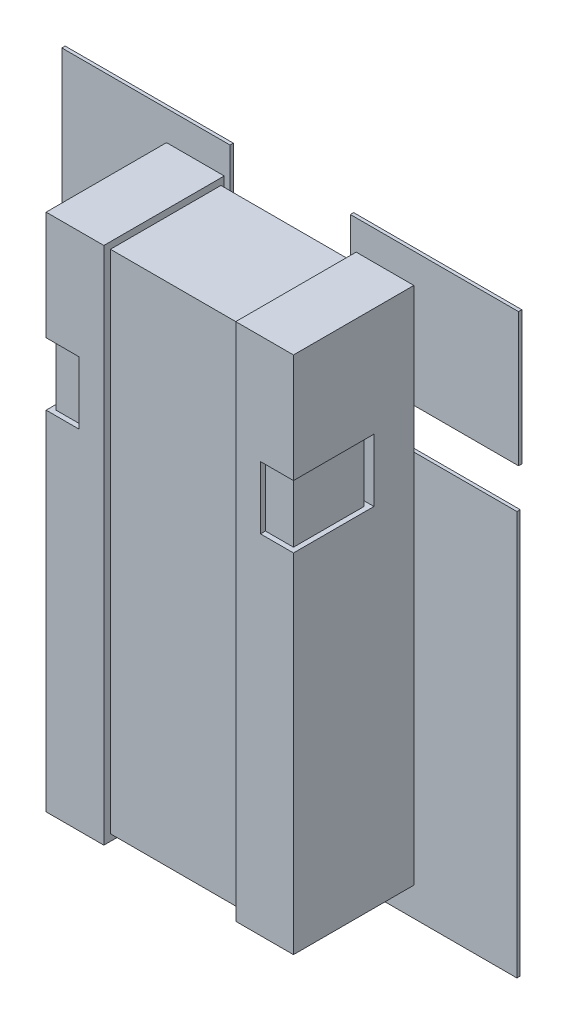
ISO-10303-21;
HEADER;
FILE_DESCRIPTION(('STEP AP214'),'2;1');
FILE_NAME('part.step','',(''),(''),'','','');
FILE_SCHEMA(('AUTOMOTIVE_DESIGN { 1 0 10303 214 1 1 1 1 }'));
ENDSEC;
DATA;
#1=APPLICATION_CONTEXT('core data for automotive mechanical design processes');
#2=APPLICATION_PROTOCOL_DEFINITION('international standard','automotive_design',2000,#1);
#3=PRODUCT_CONTEXT('',#1,'mechanical');
#4=PRODUCT('Part','Part','',(#3));
#5=PRODUCT_RELATED_PRODUCT_CATEGORY('part','',(#4));
#6=PRODUCT_DEFINITION_FORMATION('','',#4);
#7=PRODUCT_DEFINITION_CONTEXT('part definition',#1,'design');
#8=PRODUCT_DEFINITION('design','',#6,#7);
#9=PRODUCT_DEFINITION_SHAPE('','',#8);
#10=(LENGTH_UNIT() NAMED_UNIT(*) SI_UNIT(.MILLI.,.METRE.));
#11=(NAMED_UNIT(*) PLANE_ANGLE_UNIT() SI_UNIT($,.RADIAN.));
#12=(NAMED_UNIT(*) SI_UNIT($,.STERADIAN.) SOLID_ANGLE_UNIT());
#13=UNCERTAINTY_MEASURE_WITH_UNIT(LENGTH_MEASURE(1.E-05),#10,'distance_accuracy_value','');
#14=(GEOMETRIC_REPRESENTATION_CONTEXT(3) GLOBAL_UNCERTAINTY_ASSIGNED_CONTEXT((#13)) GLOBAL_UNIT_ASSIGNED_CONTEXT((#10,
#11,#12)) REPRESENTATION_CONTEXT('',''));
#15=CARTESIAN_POINT('',(0.,0.,0.));
#16=DIRECTION('',(0.,0.,1.));
#17=DIRECTION('',(1.,0.,0.));
#18=AXIS2_PLACEMENT_3D('',#15,#16,#17);
#19=CARTESIAN_POINT('',(0.550000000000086,0.534999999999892,0.826262));
#20=DIRECTION('',(0.,-1.,0.));
#21=DIRECTION('',(0.,0.,-1.));
#22=AXIS2_PLACEMENT_3D('',#19,#20,#21);
#23=PLANE('',#22);
#24=DIRECTION('',(-1.,0.,0.));
#25=VECTOR('',#24,1.);
#26=CARTESIAN_POINT('',(-0.750000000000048,0.534999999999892,0.79626200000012));
#27=LINE('',#26,#25);
#28=CARTESIAN_POINT('',(-0.550000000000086,0.534999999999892,0.79626200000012));
#29=VERTEX_POINT('',#28);
#30=CARTESIAN_POINT('',(-0.719999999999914,0.534999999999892,0.79626200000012));
#31=VERTEX_POINT('',#30);
#32=EDGE_CURVE('E378',#29,#31,#27,.T.);
#33=ORIENTED_EDGE('',*,*,#32,.T.);
#34=DIRECTION('',(0.,0.,-1.));
#35=VECTOR('',#34,1.);
#36=CARTESIAN_POINT('',(-0.719999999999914,0.534999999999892,0.33826199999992));
#37=LINE('',#36,#35);
#38=CARTESIAN_POINT('',(-0.719999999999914,0.534999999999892,0.368262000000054));
#39=VERTEX_POINT('',#38);
#40=EDGE_CURVE('E373',#31,#39,#37,.T.);
#41=ORIENTED_EDGE('',*,*,#40,.T.);
#42=DIRECTION('',(1.,0.,0.));
#43=VECTOR('',#42,1.);
#44=CARTESIAN_POINT('',(0.750000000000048,0.534999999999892,0.368262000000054));
#45=LINE('',#44,#43);
#46=CARTESIAN_POINT('',(0.719999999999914,0.534999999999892,0.368262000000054));
#47=VERTEX_POINT('',#46);
#48=EDGE_CURVE('E368',#39,#47,#45,.T.);
#49=ORIENTED_EDGE('',*,*,#48,.T.);
#50=DIRECTION('',(0.,0.,1.));
#51=VECTOR('',#50,1.);
#52=CARTESIAN_POINT('',(0.719999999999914,0.534999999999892,0.826262));
#53=LINE('',#52,#51);
#54=CARTESIAN_POINT('',(0.719999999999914,0.534999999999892,0.79626200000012));
#55=VERTEX_POINT('',#54);
#56=EDGE_CURVE('E357',#47,#55,#53,.T.);
#57=ORIENTED_EDGE('',*,*,#56,.T.);
#58=DIRECTION('',(1.,0.,0.));
#59=VECTOR('',#58,1.);
#60=CARTESIAN_POINT('',(0.550000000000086,0.534999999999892,0.79626200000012));
#61=LINE('',#60,#59);
#62=CARTESIAN_POINT('',(0.550000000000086,0.534999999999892,0.79626200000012));
#63=VERTEX_POINT('',#62);
#64=EDGE_CURVE('E329',#63,#55,#61,.T.);
#65=ORIENTED_EDGE('',*,*,#64,.F.);
#66=DIRECTION('',(0.,0.,-1.));
#67=VECTOR('',#66,1.);
#68=CARTESIAN_POINT('',(0.550000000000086,0.534999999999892,0.826262));
#69=LINE('',#68,#67);
#70=CARTESIAN_POINT('',(0.550000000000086,0.534999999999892,0.826262));
#71=VERTEX_POINT('',#70);
#72=EDGE_CURVE('E333',#71,#63,#69,.T.);
#73=ORIENTED_EDGE('',*,*,#72,.F.);
#74=DIRECTION('',(1.,0.,0.));
#75=VECTOR('',#74,1.);
#76=CARTESIAN_POINT('',(0.550000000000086,0.534999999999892,0.826262));
#77=LINE('',#76,#75);
#78=CARTESIAN_POINT('',(0.750000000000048,0.534999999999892,0.826262));
#79=VERTEX_POINT('',#78);
#80=EDGE_CURVE('E339',#79,#71,#77,.F.);
#81=ORIENTED_EDGE('',*,*,#80,.F.);
#82=DIRECTION('',(0.,0.,-1.));
#83=VECTOR('',#82,1.);
#84=CARTESIAN_POINT('',(0.750000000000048,0.534999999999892,0.826262));
#85=LINE('',#84,#83);
#86=CARTESIAN_POINT('',(0.750000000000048,0.534999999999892,0.33826199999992));
#87=VERTEX_POINT('',#86);
#88=EDGE_CURVE('E302',#87,#79,#85,.F.);
#89=ORIENTED_EDGE('',*,*,#88,.F.);
#90=DIRECTION('',(-1.,0.,0.));
#91=VECTOR('',#90,1.);
#92=CARTESIAN_POINT('',(0.750000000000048,0.534999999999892,0.33826199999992));
#93=LINE('',#92,#91);
#94=CARTESIAN_POINT('',(-0.750000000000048,0.534999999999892,0.33826199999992));
#95=VERTEX_POINT('',#94);
#96=EDGE_CURVE('E299',#87,#95,#93,.T.);
#97=ORIENTED_EDGE('',*,*,#96,.T.);
#98=DIRECTION('',(0.,0.,-1.));
#99=VECTOR('',#98,1.);
#100=CARTESIAN_POINT('',(-0.750000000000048,0.534999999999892,0.826262));
#101=LINE('',#100,#99);
#102=CARTESIAN_POINT('',(-0.750000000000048,0.534999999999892,0.826262));
#103=VERTEX_POINT('',#102);
#104=EDGE_CURVE('E296',#103,#95,#101,.T.);
#105=ORIENTED_EDGE('',*,*,#104,.F.);
#106=DIRECTION('',(1.,0.,0.));
#107=VECTOR('',#106,1.);
#108=CARTESIAN_POINT('',(0.550000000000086,0.534999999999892,0.826262));
#109=LINE('',#108,#107);
#110=CARTESIAN_POINT('',(-0.550000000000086,0.534999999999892,0.826262));
#111=VERTEX_POINT('',#110);
#112=EDGE_CURVE('E19',#111,#103,#109,.F.);
#113=ORIENTED_EDGE('',*,*,#112,.F.);
#114=DIRECTION('',(0.,0.,-1.));
#115=VECTOR('',#114,1.);
#116=CARTESIAN_POINT('',(-0.550000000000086,0.534999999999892,0.826262));
#117=LINE('',#116,#115);
#118=EDGE_CURVE('E324',#29,#111,#117,.F.);
#119=ORIENTED_EDGE('',*,*,#118,.F.);
#120=EDGE_LOOP('',(#33,#41,#49,#57,#65,#73,#81,#89,#97,#105,#113,#119));
#121=FACE_BOUND('',#120,.T.);
#122=ADVANCED_FACE('F16',(#121),#23,.F.);
#123=CARTESIAN_POINT('',(0.,0.,0.0762));
#124=DIRECTION('',(0.,0.,1.));
#125=DIRECTION('',(1.,0.,0.));
#126=AXIS2_PLACEMENT_3D('',#123,#124,#125);
#127=PLANE('',#126);
#128=DIRECTION('',(0.,1.,0.));
#129=VECTOR('',#128,1.);
#130=CARTESIAN_POINT('',(-0.365000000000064,0.94500000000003,0.0762));
#131=LINE('',#130,#129);
#132=CARTESIAN_POINT('',(-0.365000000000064,0.94500000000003,0.0762));
#133=VERTEX_POINT('',#132);
#134=CARTESIAN_POINT('',(-0.365000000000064,1.75500000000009,0.0762));
#135=VERTEX_POINT('',#134);
#136=EDGE_CURVE('E456',#133,#135,#131,.T.);
#137=ORIENTED_EDGE('',*,*,#136,.F.);
#138=DIRECTION('',(1.,0.,0.));
#139=VECTOR('',#138,1.);
#140=CARTESIAN_POINT('',(-1.38500000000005,0.94500000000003,0.0762));
#141=LINE('',#140,#139);
#142=CARTESIAN_POINT('',(-1.38500000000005,0.94500000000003,0.0762));
#143=VERTEX_POINT('',#142);
#144=EDGE_CURVE('E441',#143,#133,#141,.T.);
#145=ORIENTED_EDGE('',*,*,#144,.F.);
#146=DIRECTION('',(0.,1.,0.));
#147=VECTOR('',#146,1.);
#148=CARTESIAN_POINT('',(-1.38500000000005,1.75500000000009,0.0762));
#149=LINE('',#148,#147);
#150=CARTESIAN_POINT('',(-1.38500000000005,1.75500000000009,0.0762));
#151=VERTEX_POINT('',#150);
#152=EDGE_CURVE('E446',#151,#143,#149,.F.);
#153=ORIENTED_EDGE('',*,*,#152,.F.);
#154=DIRECTION('',(1.,0.,0.));
#155=VECTOR('',#154,1.);
#156=CARTESIAN_POINT('',(-0.365000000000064,1.75500000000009,0.0762));
#157=LINE('',#156,#155);
#158=EDGE_CURVE('E451',#135,#151,#157,.F.);
#159=ORIENTED_EDGE('',*,*,#158,.F.);
#160=EDGE_LOOP('',(#137,#145,#153,#159));
#161=FACE_BOUND('',#160,.T.);
#162=ADVANCED_FACE('F1171',(#161),#127,.F.);
#163=CARTESIAN_POINT('',(0.,0.,0.0762));
#164=DIRECTION('',(0.,0.,1.));
#165=DIRECTION('',(1.,0.,0.));
#166=AXIS2_PLACEMENT_3D('',#163,#164,#165);
#167=PLANE('',#166);
#168=DIRECTION('',(1.,0.,0.));
#169=VECTOR('',#168,1.);
#170=CARTESIAN_POINT('',(-1.37500000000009,-1.75000000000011,0.0762));
#171=LINE('',#170,#169);
#172=CARTESIAN_POINT('',(-1.37500000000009,-1.75000000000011,0.0762));
#173=VERTEX_POINT('',#172);
#174=CARTESIAN_POINT('',(-0.375000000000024,-1.75000000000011,0.0762));
#175=VERTEX_POINT('',#174);
#176=EDGE_CURVE('E431',#173,#175,#171,.T.);
#177=ORIENTED_EDGE('',*,*,#176,.F.);
#178=DIRECTION('',(0.,1.,0.));
#179=VECTOR('',#178,1.);
#180=CARTESIAN_POINT('',(-1.37500000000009,0.699999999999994,0.0762));
#181=LINE('',#180,#179);
#182=CARTESIAN_POINT('',(-1.37500000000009,0.699999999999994,0.0762));
#183=VERTEX_POINT('',#182);
#184=EDGE_CURVE('E436',#183,#173,#181,.F.);
#185=ORIENTED_EDGE('',*,*,#184,.F.);
#186=DIRECTION('',(1.,0.,0.));
#187=VECTOR('',#186,1.);
#188=CARTESIAN_POINT('',(0.,0.699999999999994,0.0762));
#189=LINE('',#188,#187);
#190=CARTESIAN_POINT('',(-0.375000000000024,0.699999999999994,0.0762));
#191=VERTEX_POINT('',#190);
#192=EDGE_CURVE('E328',#191,#183,#189,.F.);
#193=ORIENTED_EDGE('',*,*,#192,.F.);
#194=DIRECTION('',(0.,1.,0.));
#195=VECTOR('',#194,1.);
#196=CARTESIAN_POINT('',(-0.375000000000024,-1.75000000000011,0.0762));
#197=LINE('',#196,#195);
#198=EDGE_CURVE('E425',#175,#191,#197,.T.);
#199=ORIENTED_EDGE('',*,*,#198,.F.);
#200=EDGE_LOOP('',(#177,#185,#193,#199));
#201=FACE_BOUND('',#200,.T.);
#202=ADVANCED_FACE('F1161',(#201),#167,.F.);
#203=CARTESIAN_POINT('',(0.,0.,0.0762));
#204=DIRECTION('',(0.,0.,1.));
#205=DIRECTION('',(1.,0.,0.));
#206=AXIS2_PLACEMENT_3D('',#203,#204,#205);
#207=PLANE('',#206);
#208=DIRECTION('',(1.,0.,0.));
#209=VECTOR('',#208,1.);
#210=CARTESIAN_POINT('',(0.375000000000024,-1.75000000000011,0.0762));
#211=LINE('',#210,#209);
#212=CARTESIAN_POINT('',(0.375000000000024,-1.75000000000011,0.0762));
#213=VERTEX_POINT('',#212);
#214=CARTESIAN_POINT('',(1.37500000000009,-1.75000000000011,0.0762));
#215=VERTEX_POINT('',#214);
#216=EDGE_CURVE('E397',#213,#215,#211,.T.);
#217=ORIENTED_EDGE('',*,*,#216,.F.);
#218=DIRECTION('',(0.,1.,0.));
#219=VECTOR('',#218,1.);
#220=CARTESIAN_POINT('',(0.375000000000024,0.699999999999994,0.0762));
#221=LINE('',#220,#219);
#222=CARTESIAN_POINT('',(0.375000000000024,0.699999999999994,0.0762));
#223=VERTEX_POINT('',#222);
#224=EDGE_CURVE('E395',#223,#213,#221,.F.);
#225=ORIENTED_EDGE('',*,*,#224,.F.);
#226=DIRECTION('',(1.,0.,0.));
#227=VECTOR('',#226,1.);
#228=CARTESIAN_POINT('',(0.,0.699999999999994,0.0762));
#229=LINE('',#228,#227);
#230=CARTESIAN_POINT('',(1.37500000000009,0.699999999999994,0.0762));
#231=VERTEX_POINT('',#230);
#232=EDGE_CURVE('E331',#231,#223,#229,.F.);
#233=ORIENTED_EDGE('',*,*,#232,.F.);
#234=DIRECTION('',(0.,1.,0.));
#235=VECTOR('',#234,1.);
#236=CARTESIAN_POINT('',(1.37500000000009,-1.75000000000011,0.0762));
#237=LINE('',#236,#235);
#238=EDGE_CURVE('E411',#215,#231,#237,.T.);
#239=ORIENTED_EDGE('',*,*,#238,.F.);
#240=EDGE_LOOP('',(#217,#225,#233,#239));
#241=FACE_BOUND('',#240,.T.);
#242=ADVANCED_FACE('F396',(#241),#207,.F.);
#243=CARTESIAN_POINT('',(0.,0.,0.0762));
#244=DIRECTION('',(0.,0.,1.));
#245=DIRECTION('',(1.,0.,0.));
#246=AXIS2_PLACEMENT_3D('',#243,#244,#245);
#247=PLANE('',#246);
#248=DIRECTION('',(1.,0.,0.));
#249=VECTOR('',#248,1.);
#250=CARTESIAN_POINT('',(0.365000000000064,0.94500000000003,0.0762));
#251=LINE('',#250,#249);
#252=CARTESIAN_POINT('',(0.365000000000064,0.94500000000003,0.0762));
#253=VERTEX_POINT('',#252);
#254=CARTESIAN_POINT('',(1.38500000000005,0.94500000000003,0.0762));
#255=VERTEX_POINT('',#254);
#256=EDGE_CURVE('E497',#253,#255,#251,.T.);
#257=ORIENTED_EDGE('',*,*,#256,.F.);
#258=DIRECTION('',(0.,1.,0.));
#259=VECTOR('',#258,1.);
#260=CARTESIAN_POINT('',(0.365000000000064,1.75500000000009,0.0762));
#261=LINE('',#260,#259);
#262=CARTESIAN_POINT('',(0.365000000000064,1.75500000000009,0.0762));
#263=VERTEX_POINT('',#262);
#264=EDGE_CURVE('E502',#263,#253,#261,.F.);
#265=ORIENTED_EDGE('',*,*,#264,.F.);
#266=DIRECTION('',(1.,0.,0.));
#267=VECTOR('',#266,1.);
#268=CARTESIAN_POINT('',(1.38500000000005,1.75500000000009,0.0762));
#269=LINE('',#268,#267);
#270=CARTESIAN_POINT('',(1.38500000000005,1.75500000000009,0.0762));
#271=VERTEX_POINT('',#270);
#272=EDGE_CURVE('E507',#271,#263,#269,.F.);
#273=ORIENTED_EDGE('',*,*,#272,.F.);
#274=DIRECTION('',(0.,1.,0.));
#275=VECTOR('',#274,1.);
#276=CARTESIAN_POINT('',(1.38500000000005,0.94500000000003,0.0762));
#277=LINE('',#276,#275);
#278=EDGE_CURVE('E407',#255,#271,#277,.T.);
#279=ORIENTED_EDGE('',*,*,#278,.F.);
#280=EDGE_LOOP('',(#257,#265,#273,#279));
#281=FACE_BOUND('',#280,.T.);
#282=ADVANCED_FACE('F522',(#281),#247,.F.);
#283=CARTESIAN_POINT('',(-0.750000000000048,0.534999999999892,0.79626200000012));
#284=DIRECTION('',(0.,0.,-1.));
#285=DIRECTION('',(-1.,0.,0.));
#286=AXIS2_PLACEMENT_3D('',#283,#284,#285);
#287=PLANE('',#286);
#288=DIRECTION('',(0.,1.,0.));
#289=VECTOR('',#288,1.);
#290=CARTESIAN_POINT('',(-0.550000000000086,-1.57500000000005,0.79626200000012));
#291=LINE('',#290,#289);
#292=CARTESIAN_POINT('',(-0.550000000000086,0.914999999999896,0.79626200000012));
#293=VERTEX_POINT('',#292);
#294=EDGE_CURVE('E326',#29,#293,#291,.T.);
#295=ORIENTED_EDGE('',*,*,#294,.T.);
#296=DIRECTION('',(1.,0.,0.));
#297=VECTOR('',#296,1.);
#298=CARTESIAN_POINT('',(0.550000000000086,0.914999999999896,0.79626200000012));
#299=LINE('',#298,#297);
#300=CARTESIAN_POINT('',(-0.719999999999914,0.914999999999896,0.79626200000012));
#301=VERTEX_POINT('',#300);
#302=EDGE_CURVE('E490',#293,#301,#299,.F.);
#303=ORIENTED_EDGE('',*,*,#302,.T.);
#304=DIRECTION('',(0.,1.,0.));
#305=VECTOR('',#304,1.);
#306=CARTESIAN_POINT('',(-0.719999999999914,0.534999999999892,0.79626200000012));
#307=LINE('',#306,#305);
#308=EDGE_CURVE('E375',#301,#31,#307,.F.);
#309=ORIENTED_EDGE('',*,*,#308,.T.);
#310=ORIENTED_EDGE('',*,*,#32,.F.);
#311=EDGE_LOOP('',(#295,#303,#309,#310));
#312=FACE_BOUND('',#311,.T.);
#313=ADVANCED_FACE('F637',(#312),#287,.F.);
#314=CARTESIAN_POINT('',(-0.719999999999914,0.534999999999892,0.33826199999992));
#315=DIRECTION('',(1.,0.,0.));
#316=DIRECTION('',(0.,0.,-1.));
#317=AXIS2_PLACEMENT_3D('',#314,#315,#316);
#318=PLANE('',#317);
#319=ORIENTED_EDGE('',*,*,#308,.F.);
#320=DIRECTION('',(0.,0.,1.));
#321=VECTOR('',#320,1.);
#322=CARTESIAN_POINT('',(-0.719999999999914,0.914999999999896,0.79626200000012));
#323=LINE('',#322,#321);
#324=CARTESIAN_POINT('',(-0.719999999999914,0.914999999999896,0.368262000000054));
#325=VERTEX_POINT('',#324);
#326=EDGE_CURVE('E487',#301,#325,#323,.F.);
#327=ORIENTED_EDGE('',*,*,#326,.T.);
#328=DIRECTION('',(0.,1.,0.));
#329=VECTOR('',#328,1.);
#330=CARTESIAN_POINT('',(-0.719999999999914,0.534999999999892,0.368262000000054));
#331=LINE('',#330,#329);
#332=EDGE_CURVE('E370',#325,#39,#331,.F.);
#333=ORIENTED_EDGE('',*,*,#332,.T.);
#334=ORIENTED_EDGE('',*,*,#40,.F.);
#335=EDGE_LOOP('',(#319,#327,#333,#334));
#336=FACE_BOUND('',#335,.T.);
#337=ADVANCED_FACE('F641',(#336),#318,.F.);
#338=CARTESIAN_POINT('',(0.750000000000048,0.534999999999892,0.368262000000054));
#339=DIRECTION('',(0.,0.,1.));
#340=DIRECTION('',(1.,0.,0.));
#341=AXIS2_PLACEMENT_3D('',#338,#339,#340);
#342=PLANE('',#341);
#343=ORIENTED_EDGE('',*,*,#332,.F.);
#344=DIRECTION('',(1.,0.,0.));
#345=VECTOR('',#344,1.);
#346=CARTESIAN_POINT('',(0.550000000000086,0.914999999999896,0.368262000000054));
#347=LINE('',#346,#345);
#348=CARTESIAN_POINT('',(0.719999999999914,0.914999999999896,0.368262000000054));
#349=VERTEX_POINT('',#348);
#350=EDGE_CURVE('E482',#325,#349,#347,.T.);
#351=ORIENTED_EDGE('',*,*,#350,.T.);
#352=DIRECTION('',(0.,1.,0.));
#353=VECTOR('',#352,1.);
#354=CARTESIAN_POINT('',(0.719999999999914,0.534999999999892,0.368262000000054));
#355=LINE('',#354,#353);
#356=EDGE_CURVE('E362',#349,#47,#355,.F.);
#357=ORIENTED_EDGE('',*,*,#356,.T.);
#358=ORIENTED_EDGE('',*,*,#48,.F.);
#359=EDGE_LOOP('',(#343,#351,#357,#358));
#360=FACE_BOUND('',#359,.T.);
#361=ADVANCED_FACE('F643',(#360),#342,.F.);
#362=CARTESIAN_POINT('',(0.719999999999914,0.534999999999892,0.826262));
#363=DIRECTION('',(-1.,0.,0.));
#364=DIRECTION('',(0.,0.,1.));
#365=AXIS2_PLACEMENT_3D('',#362,#363,#364);
#366=PLANE('',#365);
#367=ORIENTED_EDGE('',*,*,#356,.F.);
#368=DIRECTION('',(0.,0.,1.));
#369=VECTOR('',#368,1.);
#370=CARTESIAN_POINT('',(0.719999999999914,0.914999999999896,0.79626200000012));
#371=LINE('',#370,#369);
#372=CARTESIAN_POINT('',(0.719999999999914,0.914999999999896,0.79626200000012));
#373=VERTEX_POINT('',#372);
#374=EDGE_CURVE('E464',#349,#373,#371,.T.);
#375=ORIENTED_EDGE('',*,*,#374,.T.);
#376=DIRECTION('',(0.,1.,0.));
#377=VECTOR('',#376,1.);
#378=CARTESIAN_POINT('',(0.719999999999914,0.534999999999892,0.79626200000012));
#379=LINE('',#378,#377);
#380=EDGE_CURVE('E359',#373,#55,#379,.F.);
#381=ORIENTED_EDGE('',*,*,#380,.T.);
#382=ORIENTED_EDGE('',*,*,#56,.F.);
#383=EDGE_LOOP('',(#367,#375,#381,#382));
#384=FACE_BOUND('',#383,.T.);
#385=ADVANCED_FACE('F462',(#384),#366,.F.);
#386=CARTESIAN_POINT('',(0.750000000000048,0.914999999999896,0.33826199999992));
#387=DIRECTION('',(0.,0.,-1.));
#388=DIRECTION('',(-1.,0.,0.));
#389=AXIS2_PLACEMENT_3D('',#386,#387,#388);
#390=PLANE('',#389);
#391=DIRECTION('',(1.,0.,0.));
#392=VECTOR('',#391,1.);
#393=CARTESIAN_POINT('',(0.550000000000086,0.914999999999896,0.33826199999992));
#394=LINE('',#393,#392);
#395=CARTESIAN_POINT('',(0.750000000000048,0.914999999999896,0.33826199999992));
#396=VERTEX_POINT('',#395);
#397=CARTESIAN_POINT('',(-0.750000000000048,0.914999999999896,0.33826199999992));
#398=VERTEX_POINT('',#397);
#399=EDGE_CURVE('E478',#396,#398,#394,.F.);
#400=ORIENTED_EDGE('',*,*,#399,.T.);
#401=DIRECTION('',(0.,1.,0.));
#402=VECTOR('',#401,1.);
#403=CARTESIAN_POINT('',(-0.750000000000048,0.534999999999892,0.33826199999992));
#404=LINE('',#403,#402);
#405=EDGE_CURVE('E356',#95,#398,#404,.T.);
#406=ORIENTED_EDGE('',*,*,#405,.F.);
#407=ORIENTED_EDGE('',*,*,#96,.F.);
#408=DIRECTION('',(0.,1.,0.));
#409=VECTOR('',#408,1.);
#410=CARTESIAN_POINT('',(0.750000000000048,0.914999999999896,0.33826199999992));
#411=LINE('',#410,#409);
#412=EDGE_CURVE('E351',#396,#87,#411,.F.);
#413=ORIENTED_EDGE('',*,*,#412,.F.);
#414=EDGE_LOOP('',(#400,#406,#407,#413));
#415=FACE_BOUND('',#414,.T.);
#416=ADVANCED_FACE('F354',(#415),#390,.F.);
#417=CARTESIAN_POINT('',(0.550000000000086,0.534999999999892,0.79626200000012));
#418=DIRECTION('',(0.,0.,-1.));
#419=DIRECTION('',(-1.,0.,0.));
#420=AXIS2_PLACEMENT_3D('',#417,#418,#419);
#421=PLANE('',#420);
#422=ORIENTED_EDGE('',*,*,#380,.F.);
#423=DIRECTION('',(1.,0.,0.));
#424=VECTOR('',#423,1.);
#425=CARTESIAN_POINT('',(0.550000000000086,0.914999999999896,0.79626200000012));
#426=LINE('',#425,#424);
#427=CARTESIAN_POINT('',(0.550000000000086,0.914999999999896,0.79626200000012));
#428=VERTEX_POINT('',#427);
#429=EDGE_CURVE('E470',#373,#428,#426,.F.);
#430=ORIENTED_EDGE('',*,*,#429,.T.);
#431=DIRECTION('',(0.,1.,0.));
#432=VECTOR('',#431,1.);
#433=CARTESIAN_POINT('',(0.550000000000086,-1.57500000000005,0.79626200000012));
#434=LINE('',#433,#432);
#435=EDGE_CURVE('E626',#63,#428,#434,.T.);
#436=ORIENTED_EDGE('',*,*,#435,.F.);
#437=ORIENTED_EDGE('',*,*,#64,.T.);
#438=EDGE_LOOP('',(#422,#430,#436,#437));
#439=FACE_BOUND('',#438,.T.);
#440=ADVANCED_FACE('F468',(#439),#421,.F.);
#441=CARTESIAN_POINT('',(-0.550000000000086,-1.57500000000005,0.826262));
#442=DIRECTION('',(1.,0.,0.));
#443=DIRECTION('',(0.,0.,-1.));
#444=AXIS2_PLACEMENT_3D('',#441,#442,#443);
#445=PLANE('',#444);
#446=ORIENTED_EDGE('',*,*,#294,.F.);
#447=ORIENTED_EDGE('',*,*,#118,.T.);
#448=DIRECTION('',(0.,1.,0.));
#449=VECTOR('',#448,1.);
#450=CARTESIAN_POINT('',(-0.550000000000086,0.,0.826262));
#451=LINE('',#450,#449);
#452=CARTESIAN_POINT('',(-0.550000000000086,0.914999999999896,0.826262));
#453=VERTEX_POINT('',#452);
#454=EDGE_CURVE('E315',#453,#111,#451,.F.);
#455=ORIENTED_EDGE('',*,*,#454,.F.);
#456=DIRECTION('',(0.,0.,1.));
#457=VECTOR('',#456,1.);
#458=CARTESIAN_POINT('',(-0.550000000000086,0.914999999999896,0.79626200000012));
#459=LINE('',#458,#457);
#460=EDGE_CURVE('E493',#453,#293,#459,.F.);
#461=ORIENTED_EDGE('',*,*,#460,.T.);
#462=EDGE_LOOP('',(#446,#447,#455,#461));
#463=FACE_BOUND('',#462,.T.);
#464=ADVANCED_FACE('F325',(#463),#445,.F.);
#465=CARTESIAN_POINT('',(-0.365000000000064,0.94500000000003,0.0762));
#466=DIRECTION('',(1.,0.,0.));
#467=DIRECTION('',(0.,0.,-1.));
#468=AXIS2_PLACEMENT_3D('',#465,#466,#467);
#469=PLANE('',#468);
#470=DIRECTION('',(0.,0.,-1.));
#471=VECTOR('',#470,1.);
#472=CARTESIAN_POINT('',(-0.365000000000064,0.94500000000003,0.0762));
#473=LINE('',#472,#471);
#474=CARTESIAN_POINT('',(-0.365000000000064,0.94500000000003,0.0961999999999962));
#475=VERTEX_POINT('',#474);
#476=EDGE_CURVE('E439',#133,#475,#473,.F.);
#477=ORIENTED_EDGE('',*,*,#476,.F.);
#478=ORIENTED_EDGE('',*,*,#136,.T.);
#479=DIRECTION('',(0.,0.,1.));
#480=VECTOR('',#479,1.);
#481=CARTESIAN_POINT('',(-0.365000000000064,1.75500000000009,0.0762));
#482=LINE('',#481,#480);
#483=CARTESIAN_POINT('',(-0.365000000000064,1.75500000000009,0.0961999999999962));
#484=VERTEX_POINT('',#483);
#485=EDGE_CURVE('E453',#484,#135,#482,.F.);
#486=ORIENTED_EDGE('',*,*,#485,.F.);
#487=DIRECTION('',(0.,1.,0.));
#488=VECTOR('',#487,1.);
#489=CARTESIAN_POINT('',(-0.365000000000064,0.,0.0961999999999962));
#490=LINE('',#489,#488);
#491=EDGE_CURVE('E608',#475,#484,#490,.T.);
#492=ORIENTED_EDGE('',*,*,#491,.F.);
#493=EDGE_LOOP('',(#477,#478,#486,#492));
#494=FACE_BOUND('',#493,.T.);
#495=ADVANCED_FACE('F1082',(#494),#469,.T.);
#496=CARTESIAN_POINT('',(-0.365000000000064,1.75500000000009,0.0762));
#497=DIRECTION('',(0.,1.,0.));
#498=DIRECTION('',(0.,0.,1.));
#499=AXIS2_PLACEMENT_3D('',#496,#497,#498);
#500=PLANE('',#499);
#501=ORIENTED_EDGE('',*,*,#485,.T.);
#502=ORIENTED_EDGE('',*,*,#158,.T.);
#503=DIRECTION('',(0.,0.,1.));
#504=VECTOR('',#503,1.);
#505=CARTESIAN_POINT('',(-1.38500000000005,1.75500000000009,0.0762));
#506=LINE('',#505,#504);
#507=CARTESIAN_POINT('',(-1.38500000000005,1.75500000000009,0.0961999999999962));
#508=VERTEX_POINT('',#507);
#509=EDGE_CURVE('E448',#508,#151,#506,.F.);
#510=ORIENTED_EDGE('',*,*,#509,.F.);
#511=DIRECTION('',(1.,0.,0.));
#512=VECTOR('',#511,1.);
#513=CARTESIAN_POINT('',(0.,1.75500000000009,0.0961999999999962));
#514=LINE('',#513,#512);
#515=EDGE_CURVE('E606',#484,#508,#514,.F.);
#516=ORIENTED_EDGE('',*,*,#515,.F.);
#517=EDGE_LOOP('',(#501,#502,#510,#516));
#518=FACE_BOUND('',#517,.T.);
#519=ADVANCED_FACE('F1071',(#518),#500,.T.);
#520=CARTESIAN_POINT('',(-1.38500000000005,1.75500000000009,0.0762));
#521=DIRECTION('',(-1.,0.,0.));
#522=DIRECTION('',(0.,0.,1.));
#523=AXIS2_PLACEMENT_3D('',#520,#521,#522);
#524=PLANE('',#523);
#525=ORIENTED_EDGE('',*,*,#509,.T.);
#526=ORIENTED_EDGE('',*,*,#152,.T.);
#527=DIRECTION('',(0.,0.,-1.));
#528=VECTOR('',#527,1.);
#529=CARTESIAN_POINT('',(-1.38500000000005,0.94500000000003,0.0762));
#530=LINE('',#529,#528);
#531=CARTESIAN_POINT('',(-1.38500000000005,0.94500000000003,0.0961999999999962));
#532=VERTEX_POINT('',#531);
#533=EDGE_CURVE('E443',#532,#143,#530,.T.);
#534=ORIENTED_EDGE('',*,*,#533,.F.);
#535=DIRECTION('',(0.,1.,0.));
#536=VECTOR('',#535,1.);
#537=CARTESIAN_POINT('',(-1.38500000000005,0.,0.0961999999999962));
#538=LINE('',#537,#536);
#539=EDGE_CURVE('E604',#508,#532,#538,.F.);
#540=ORIENTED_EDGE('',*,*,#539,.F.);
#541=EDGE_LOOP('',(#525,#526,#534,#540));
#542=FACE_BOUND('',#541,.T.);
#543=ADVANCED_FACE('F1060',(#542),#524,.T.);
#544=CARTESIAN_POINT('',(-1.38500000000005,0.94500000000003,0.0762));
#545=DIRECTION('',(0.,-1.,0.));
#546=DIRECTION('',(0.,0.,-1.));
#547=AXIS2_PLACEMENT_3D('',#544,#545,#546);
#548=PLANE('',#547);
#549=DIRECTION('',(1.,0.,0.));
#550=VECTOR('',#549,1.);
#551=CARTESIAN_POINT('',(0.,0.94500000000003,0.0961999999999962));
#552=LINE('',#551,#550);
#553=CARTESIAN_POINT('',(-0.399999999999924,0.94500000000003,0.0961999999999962));
#554=VERTEX_POINT('',#553);
#555=CARTESIAN_POINT('',(-0.750000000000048,0.94500000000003,0.0961999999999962));
#556=VERTEX_POINT('',#555);
#557=EDGE_CURVE('E599',#554,#556,#552,.F.);
#558=ORIENTED_EDGE('',*,*,#557,.T.);
#559=DIRECTION('',(1.,0.,0.));
#560=VECTOR('',#559,1.);
#561=CARTESIAN_POINT('',(0.,0.94500000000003,0.0961999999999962));
#562=LINE('',#561,#560);
#563=EDGE_CURVE('E602',#532,#556,#562,.T.);
#564=ORIENTED_EDGE('',*,*,#563,.F.);
#565=ORIENTED_EDGE('',*,*,#533,.T.);
#566=ORIENTED_EDGE('',*,*,#144,.T.);
#567=ORIENTED_EDGE('',*,*,#476,.T.);
#568=DIRECTION('',(1.,0.,0.));
#569=VECTOR('',#568,1.);
#570=CARTESIAN_POINT('',(0.,0.94500000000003,0.0961999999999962));
#571=LINE('',#570,#569);
#572=EDGE_CURVE('E610',#554,#475,#571,.T.);
#573=ORIENTED_EDGE('',*,*,#572,.F.);
#574=EDGE_LOOP('',(#558,#564,#565,#566,#567,#573));
#575=FACE_BOUND('',#574,.T.);
#576=ADVANCED_FACE('F1054',(#575),#548,.T.);
#577=CARTESIAN_POINT('',(-0.750000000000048,0.534999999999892,0.0762));
#578=DIRECTION('',(-1.,0.,0.));
#579=DIRECTION('',(0.,0.,1.));
#580=AXIS2_PLACEMENT_3D('',#577,#578,#579);
#581=PLANE('',#580);
#582=DIRECTION('',(0.,1.,0.));
#583=VECTOR('',#582,1.);
#584=CARTESIAN_POINT('',(-0.750000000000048,0.,0.826262));
#585=LINE('',#584,#583);
#586=CARTESIAN_POINT('',(-0.750000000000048,-1.57500000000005,0.826262));
#587=VERTEX_POINT('',#586);
#588=EDGE_CURVE('E304',#103,#587,#585,.F.);
#589=ORIENTED_EDGE('',*,*,#588,.F.);
#590=ORIENTED_EDGE('',*,*,#104,.T.);
#591=ORIENTED_EDGE('',*,*,#405,.T.);
#592=DIRECTION('',(0.,0.,1.));
#593=VECTOR('',#592,1.);
#594=CARTESIAN_POINT('',(-0.750000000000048,0.914999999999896,0.79626200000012));
#595=LINE('',#594,#593);
#596=CARTESIAN_POINT('',(-0.750000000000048,0.914999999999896,0.826262));
#597=VERTEX_POINT('',#596);
#598=EDGE_CURVE('E480',#398,#597,#595,.T.);
#599=ORIENTED_EDGE('',*,*,#598,.T.);
#600=DIRECTION('',(0.,1.,0.));
#601=VECTOR('',#600,1.);
#602=CARTESIAN_POINT('',(-0.750000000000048,0.,0.826262));
#603=LINE('',#602,#601);
#604=CARTESIAN_POINT('',(-0.750000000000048,1.57500000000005,0.826262));
#605=VERTEX_POINT('',#604);
#606=EDGE_CURVE('E621',#605,#597,#603,.F.);
#607=ORIENTED_EDGE('',*,*,#606,.F.);
#608=DIRECTION('',(0.,0.,1.));
#609=VECTOR('',#608,1.);
#610=CARTESIAN_POINT('',(-0.750000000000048,1.57500000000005,0.0762));
#611=LINE('',#610,#609);
#612=CARTESIAN_POINT('',(-0.750000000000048,1.57500000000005,0.0961999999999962));
#613=VERTEX_POINT('',#612);
#614=EDGE_CURVE('E321',#613,#605,#611,.T.);
#615=ORIENTED_EDGE('',*,*,#614,.F.);
#616=DIRECTION('',(0.,1.,0.));
#617=VECTOR('',#616,1.);
#618=CARTESIAN_POINT('',(-0.750000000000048,0.,0.0961999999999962));
#619=LINE('',#618,#617);
#620=EDGE_CURVE('E615',#556,#613,#619,.T.);
#621=ORIENTED_EDGE('',*,*,#620,.F.);
#622=DIRECTION('',(0.,1.,0.));
#623=VECTOR('',#622,1.);
#624=CARTESIAN_POINT('',(-0.750000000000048,0.,0.0961999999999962));
#625=LINE('',#624,#623);
#626=CARTESIAN_POINT('',(-0.750000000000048,0.699999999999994,0.0961999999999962));
#627=VERTEX_POINT('',#626);
#628=EDGE_CURVE('E596',#556,#627,#625,.F.);
#629=ORIENTED_EDGE('',*,*,#628,.T.);
#630=DIRECTION('',(0.,1.,0.));
#631=VECTOR('',#630,1.);
#632=CARTESIAN_POINT('',(-0.750000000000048,0.,0.0961999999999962));
#633=LINE('',#632,#631);
#634=CARTESIAN_POINT('',(-0.750000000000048,-1.57500000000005,0.0961999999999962));
#635=VERTEX_POINT('',#634);
#636=EDGE_CURVE('E587',#635,#627,#633,.T.);
#637=ORIENTED_EDGE('',*,*,#636,.F.);
#638=DIRECTION('',(0.,0.,-1.));
#639=VECTOR('',#638,1.);
#640=CARTESIAN_POINT('',(-0.750000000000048,-1.57500000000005,0.0762));
#641=LINE('',#640,#639);
#642=EDGE_CURVE('E307',#587,#635,#641,.T.);
#643=ORIENTED_EDGE('',*,*,#642,.F.);
#644=EDGE_LOOP('',(#589,#590,#591,#599,#607,#615,#621,#629,#637,#643));
#645=FACE_BOUND('',#644,.T.);
#646=ADVANCED_FACE('F305',(#645),#581,.T.);
#647=CARTESIAN_POINT('',(-1.37500000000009,0.699999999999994,0.0762));
#648=DIRECTION('',(-1.,0.,0.));
#649=DIRECTION('',(0.,0.,1.));
#650=AXIS2_PLACEMENT_3D('',#647,#648,#649);
#651=PLANE('',#650);
#652=DIRECTION('',(0.,0.,1.));
#653=VECTOR('',#652,1.);
#654=CARTESIAN_POINT('',(-1.37500000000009,0.699999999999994,0.0762));
#655=LINE('',#654,#653);
#656=CARTESIAN_POINT('',(-1.37500000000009,0.699999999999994,0.0961999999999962));
#657=VERTEX_POINT('',#656);
#658=EDGE_CURVE('E402',#183,#657,#655,.T.);
#659=ORIENTED_EDGE('',*,*,#658,.F.);
#660=ORIENTED_EDGE('',*,*,#184,.T.);
#661=DIRECTION('',(0.,0.,-1.));
#662=VECTOR('',#661,1.);
#663=CARTESIAN_POINT('',(-1.37500000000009,-1.75000000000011,0.0762));
#664=LINE('',#663,#662);
#665=CARTESIAN_POINT('',(-1.37500000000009,-1.75000000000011,0.0961999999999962));
#666=VERTEX_POINT('',#665);
#667=EDGE_CURVE('E433',#666,#173,#664,.T.);
#668=ORIENTED_EDGE('',*,*,#667,.F.);
#669=DIRECTION('',(0.,1.,0.));
#670=VECTOR('',#669,1.);
#671=CARTESIAN_POINT('',(-1.37500000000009,0.,0.0961999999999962));
#672=LINE('',#671,#670);
#673=EDGE_CURVE('E582',#657,#666,#672,.F.);
#674=ORIENTED_EDGE('',*,*,#673,.F.);
#675=EDGE_LOOP('',(#659,#660,#668,#674));
#676=FACE_BOUND('',#675,.T.);
#677=ADVANCED_FACE('F1034',(#676),#651,.T.);
#678=CARTESIAN_POINT('',(-1.37500000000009,-1.75000000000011,0.0762));
#679=DIRECTION('',(0.,-1.,0.));
#680=DIRECTION('',(0.,0.,-1.));
#681=AXIS2_PLACEMENT_3D('',#678,#679,#680);
#682=PLANE('',#681);
#683=ORIENTED_EDGE('',*,*,#667,.T.);
#684=ORIENTED_EDGE('',*,*,#176,.T.);
#685=DIRECTION('',(0.,0.,-1.));
#686=VECTOR('',#685,1.);
#687=CARTESIAN_POINT('',(-0.375000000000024,-1.75000000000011,0.0762));
#688=LINE('',#687,#686);
#689=CARTESIAN_POINT('',(-0.375000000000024,-1.75000000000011,0.0961999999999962));
#690=VERTEX_POINT('',#689);
#691=EDGE_CURVE('E428',#690,#175,#688,.T.);
#692=ORIENTED_EDGE('',*,*,#691,.F.);
#693=DIRECTION('',(1.,0.,0.));
#694=VECTOR('',#693,1.);
#695=CARTESIAN_POINT('',(0.,-1.75000000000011,0.0961999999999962));
#696=LINE('',#695,#694);
#697=EDGE_CURVE('E580',#666,#690,#696,.T.);
#698=ORIENTED_EDGE('',*,*,#697,.F.);
#699=EDGE_LOOP('',(#683,#684,#692,#698));
#700=FACE_BOUND('',#699,.T.);
#701=ADVANCED_FACE('F1027',(#700),#682,.T.);
#702=CARTESIAN_POINT('',(-0.375000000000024,-1.75000000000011,0.0762));
#703=DIRECTION('',(1.,0.,0.));
#704=DIRECTION('',(0.,0.,-1.));
#705=AXIS2_PLACEMENT_3D('',#702,#703,#704);
#706=PLANE('',#705);
#707=ORIENTED_EDGE('',*,*,#691,.T.);
#708=ORIENTED_EDGE('',*,*,#198,.T.);
#709=DIRECTION('',(0.,0.,1.));
#710=VECTOR('',#709,1.);
#711=CARTESIAN_POINT('',(-0.375000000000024,0.699999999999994,0.0762));
#712=LINE('',#711,#710);
#713=CARTESIAN_POINT('',(-0.375000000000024,0.699999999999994,0.0961999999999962));
#714=VERTEX_POINT('',#713);
#715=EDGE_CURVE('E422',#714,#191,#712,.F.);
#716=ORIENTED_EDGE('',*,*,#715,.F.);
#717=DIRECTION('',(0.,1.,0.));
#718=VECTOR('',#717,1.);
#719=CARTESIAN_POINT('',(-0.375000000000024,0.,0.0961999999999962));
#720=LINE('',#719,#718);
#721=EDGE_CURVE('E578',#690,#714,#720,.T.);
#722=ORIENTED_EDGE('',*,*,#721,.F.);
#723=EDGE_LOOP('',(#707,#708,#716,#722));
#724=FACE_BOUND('',#723,.T.);
#725=ADVANCED_FACE('F1033',(#724),#706,.T.);
#726=CARTESIAN_POINT('',(-0.375000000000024,0.699999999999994,0.0762));
#727=DIRECTION('',(0.,1.,0.));
#728=DIRECTION('',(0.,0.,1.));
#729=AXIS2_PLACEMENT_3D('',#726,#727,#728);
#730=PLANE('',#729);
#731=DIRECTION('',(1.,0.,0.));
#732=VECTOR('',#731,1.);
#733=CARTESIAN_POINT('',(0.,0.699999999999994,0.0961999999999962));
#734=LINE('',#733,#732);
#735=CARTESIAN_POINT('',(-0.399999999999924,0.699999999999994,0.0961999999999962));
#736=VERTEX_POINT('',#735);
#737=EDGE_CURVE('E593',#627,#736,#734,.T.);
#738=ORIENTED_EDGE('',*,*,#737,.T.);
#739=DIRECTION('',(1.,0.,0.));
#740=VECTOR('',#739,1.);
#741=CARTESIAN_POINT('',(0.,0.699999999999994,0.0961999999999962));
#742=LINE('',#741,#740);
#743=EDGE_CURVE('E576',#714,#736,#742,.F.);
#744=ORIENTED_EDGE('',*,*,#743,.F.);
#745=ORIENTED_EDGE('',*,*,#715,.T.);
#746=ORIENTED_EDGE('',*,*,#192,.T.);
#747=ORIENTED_EDGE('',*,*,#658,.T.);
#748=DIRECTION('',(1.,0.,0.));
#749=VECTOR('',#748,1.);
#750=CARTESIAN_POINT('',(0.,0.699999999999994,0.0961999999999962));
#751=LINE('',#750,#749);
#752=EDGE_CURVE('E584',#627,#657,#751,.F.);
#753=ORIENTED_EDGE('',*,*,#752,.F.);
#754=EDGE_LOOP('',(#738,#744,#745,#746,#747,#753));
#755=FACE_BOUND('',#754,.T.);
#756=ADVANCED_FACE('F1020',(#755),#730,.T.);
#757=CARTESIAN_POINT('',(0.375000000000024,0.699999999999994,0.0762));
#758=DIRECTION('',(-1.,0.,0.));
#759=DIRECTION('',(0.,0.,1.));
#760=AXIS2_PLACEMENT_3D('',#757,#758,#759);
#761=PLANE('',#760);
#762=DIRECTION('',(0.,0.,1.));
#763=VECTOR('',#762,1.);
#764=CARTESIAN_POINT('',(0.375000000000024,0.699999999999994,0.0762));
#765=LINE('',#764,#763);
#766=CARTESIAN_POINT('',(0.375000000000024,0.699999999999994,0.0961999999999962));
#767=VERTEX_POINT('',#766);
#768=EDGE_CURVE('E386',#223,#767,#765,.T.);
#769=ORIENTED_EDGE('',*,*,#768,.F.);
#770=ORIENTED_EDGE('',*,*,#224,.T.);
#771=DIRECTION('',(0.,0.,-1.));
#772=VECTOR('',#771,1.);
#773=CARTESIAN_POINT('',(0.375000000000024,-1.75000000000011,0.0762));
#774=LINE('',#773,#772);
#775=CARTESIAN_POINT('',(0.375000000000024,-1.75000000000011,0.0961999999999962));
#776=VERTEX_POINT('',#775);
#777=EDGE_CURVE('E401',#776,#213,#774,.T.);
#778=ORIENTED_EDGE('',*,*,#777,.F.);
#779=DIRECTION('',(0.,1.,0.));
#780=VECTOR('',#779,1.);
#781=CARTESIAN_POINT('',(0.375000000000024,0.,0.0961999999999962));
#782=LINE('',#781,#780);
#783=EDGE_CURVE('E406',#767,#776,#782,.F.);
#784=ORIENTED_EDGE('',*,*,#783,.F.);
#785=EDGE_LOOP('',(#769,#770,#778,#784));
#786=FACE_BOUND('',#785,.T.);
#787=ADVANCED_FACE('F405',(#786),#761,.T.);
#788=CARTESIAN_POINT('',(0.375000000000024,-1.75000000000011,0.0762));
#789=DIRECTION('',(0.,-1.,0.));
#790=DIRECTION('',(0.,0.,-1.));
#791=AXIS2_PLACEMENT_3D('',#788,#789,#790);
#792=PLANE('',#791);
#793=ORIENTED_EDGE('',*,*,#777,.T.);
#794=ORIENTED_EDGE('',*,*,#216,.T.);
#795=DIRECTION('',(0.,0.,-1.));
#796=VECTOR('',#795,1.);
#797=CARTESIAN_POINT('',(1.37500000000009,-1.75000000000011,0.0762));
#798=LINE('',#797,#796);
#799=CARTESIAN_POINT('',(1.37500000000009,-1.75000000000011,0.0961999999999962));
#800=VERTEX_POINT('',#799);
#801=EDGE_CURVE('E416',#800,#215,#798,.T.);
#802=ORIENTED_EDGE('',*,*,#801,.F.);
#803=DIRECTION('',(1.,0.,0.));
#804=VECTOR('',#803,1.);
#805=CARTESIAN_POINT('',(0.,-1.75000000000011,0.0961999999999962));
#806=LINE('',#805,#804);
#807=EDGE_CURVE('E565',#776,#800,#806,.T.);
#808=ORIENTED_EDGE('',*,*,#807,.F.);
#809=EDGE_LOOP('',(#793,#794,#802,#808));
#810=FACE_BOUND('',#809,.T.);
#811=ADVANCED_FACE('F999',(#810),#792,.T.);
#812=CARTESIAN_POINT('',(1.37500000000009,-1.75000000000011,0.0762));
#813=DIRECTION('',(1.,0.,0.));
#814=DIRECTION('',(0.,0.,-1.));
#815=AXIS2_PLACEMENT_3D('',#812,#813,#814);
#816=PLANE('',#815);
#817=ORIENTED_EDGE('',*,*,#801,.T.);
#818=ORIENTED_EDGE('',*,*,#238,.T.);
#819=DIRECTION('',(0.,0.,1.));
#820=VECTOR('',#819,1.);
#821=CARTESIAN_POINT('',(1.37500000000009,0.699999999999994,0.0762));
#822=LINE('',#821,#820);
#823=CARTESIAN_POINT('',(1.37500000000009,0.699999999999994,0.0961999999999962));
#824=VERTEX_POINT('',#823);
#825=EDGE_CURVE('E390',#824,#231,#822,.F.);
#826=ORIENTED_EDGE('',*,*,#825,.F.);
#827=DIRECTION('',(0.,1.,0.));
#828=VECTOR('',#827,1.);
#829=CARTESIAN_POINT('',(1.37500000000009,0.,0.0961999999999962));
#830=LINE('',#829,#828);
#831=EDGE_CURVE('E563',#800,#824,#830,.T.);
#832=ORIENTED_EDGE('',*,*,#831,.F.);
#833=EDGE_LOOP('',(#817,#818,#826,#832));
#834=FACE_BOUND('',#833,.T.);
#835=ADVANCED_FACE('F764',(#834),#816,.T.);
#836=CARTESIAN_POINT('',(1.37500000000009,0.699999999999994,0.0762));
#837=DIRECTION('',(0.,1.,0.));
#838=DIRECTION('',(0.,0.,1.));
#839=AXIS2_PLACEMENT_3D('',#836,#837,#838);
#840=PLANE('',#839);
#841=DIRECTION('',(1.,0.,0.));
#842=VECTOR('',#841,1.);
#843=CARTESIAN_POINT('',(0.,0.699999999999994,0.0961999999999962));
#844=LINE('',#843,#842);
#845=CARTESIAN_POINT('',(0.399999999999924,0.699999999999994,0.0961999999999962));
#846=VERTEX_POINT('',#845);
#847=CARTESIAN_POINT('',(0.750000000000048,0.699999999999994,0.0961999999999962));
#848=VERTEX_POINT('',#847);
#849=EDGE_CURVE('E558',#846,#848,#844,.T.);
#850=ORIENTED_EDGE('',*,*,#849,.T.);
#851=DIRECTION('',(1.,0.,0.));
#852=VECTOR('',#851,1.);
#853=CARTESIAN_POINT('',(0.,0.699999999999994,0.0961999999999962));
#854=LINE('',#853,#852);
#855=EDGE_CURVE('E561',#824,#848,#854,.F.);
#856=ORIENTED_EDGE('',*,*,#855,.F.);
#857=ORIENTED_EDGE('',*,*,#825,.T.);
#858=ORIENTED_EDGE('',*,*,#232,.T.);
#859=ORIENTED_EDGE('',*,*,#768,.T.);
#860=DIRECTION('',(1.,0.,0.));
#861=VECTOR('',#860,1.);
#862=CARTESIAN_POINT('',(0.,0.699999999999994,0.0961999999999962));
#863=LINE('',#862,#861);
#864=EDGE_CURVE('E568',#846,#767,#863,.F.);
#865=ORIENTED_EDGE('',*,*,#864,.F.);
#866=EDGE_LOOP('',(#850,#856,#857,#858,#859,#865));
#867=FACE_BOUND('',#866,.T.);
#868=ADVANCED_FACE('F383',(#867),#840,.T.);
#869=CARTESIAN_POINT('',(1.38500000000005,0.94500000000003,0.0762));
#870=DIRECTION('',(1.,0.,0.));
#871=DIRECTION('',(0.,0.,-1.));
#872=AXIS2_PLACEMENT_3D('',#869,#870,#871);
#873=PLANE('',#872);
#874=DIRECTION('',(0.,0.,-1.));
#875=VECTOR('',#874,1.);
#876=CARTESIAN_POINT('',(1.38500000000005,0.94500000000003,0.0762));
#877=LINE('',#876,#875);
#878=CARTESIAN_POINT('',(1.38500000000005,0.94500000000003,0.0961999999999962));
#879=VERTEX_POINT('',#878);
#880=EDGE_CURVE('E495',#255,#879,#877,.F.);
#881=ORIENTED_EDGE('',*,*,#880,.F.);
#882=ORIENTED_EDGE('',*,*,#278,.T.);
#883=DIRECTION('',(0.,0.,1.));
#884=VECTOR('',#883,1.);
#885=CARTESIAN_POINT('',(1.38500000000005,1.75500000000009,0.0762));
#886=LINE('',#885,#884);
#887=CARTESIAN_POINT('',(1.38500000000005,1.75500000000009,0.0961999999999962));
#888=VERTEX_POINT('',#887);
#889=EDGE_CURVE('E409',#888,#271,#886,.F.);
#890=ORIENTED_EDGE('',*,*,#889,.F.);
#891=DIRECTION('',(0.,1.,0.));
#892=VECTOR('',#891,1.);
#893=CARTESIAN_POINT('',(1.38500000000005,0.,0.0961999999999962));
#894=LINE('',#893,#892);
#895=EDGE_CURVE('E547',#879,#888,#894,.T.);
#896=ORIENTED_EDGE('',*,*,#895,.F.);
#897=EDGE_LOOP('',(#881,#882,#890,#896));
#898=FACE_BOUND('',#897,.T.);
#899=ADVANCED_FACE('F755',(#898),#873,.T.);
#900=CARTESIAN_POINT('',(1.38500000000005,1.75500000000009,0.0762));
#901=DIRECTION('',(0.,1.,0.));
#902=DIRECTION('',(0.,0.,1.));
#903=AXIS2_PLACEMENT_3D('',#900,#901,#902);
#904=PLANE('',#903);
#905=ORIENTED_EDGE('',*,*,#889,.T.);
#906=ORIENTED_EDGE('',*,*,#272,.T.);
#907=DIRECTION('',(0.,0.,1.));
#908=VECTOR('',#907,1.);
#909=CARTESIAN_POINT('',(0.365000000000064,1.75500000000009,0.0762));
#910=LINE('',#909,#908);
#911=CARTESIAN_POINT('',(0.365000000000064,1.75500000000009,0.0961999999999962));
#912=VERTEX_POINT('',#911);
#913=EDGE_CURVE('E504',#912,#263,#910,.F.);
#914=ORIENTED_EDGE('',*,*,#913,.F.);
#915=DIRECTION('',(1.,0.,0.));
#916=VECTOR('',#915,1.);
#917=CARTESIAN_POINT('',(0.,1.75500000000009,0.0961999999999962));
#918=LINE('',#917,#916);
#919=EDGE_CURVE('E515',#888,#912,#918,.F.);
#920=ORIENTED_EDGE('',*,*,#919,.F.);
#921=EDGE_LOOP('',(#905,#906,#914,#920));
#922=FACE_BOUND('',#921,.T.);
#923=ADVANCED_FACE('F513',(#922),#904,.T.);
#924=CARTESIAN_POINT('',(0.365000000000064,1.75500000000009,0.0762));
#925=DIRECTION('',(-1.,0.,0.));
#926=DIRECTION('',(0.,0.,1.));
#927=AXIS2_PLACEMENT_3D('',#924,#925,#926);
#928=PLANE('',#927);
#929=ORIENTED_EDGE('',*,*,#913,.T.);
#930=ORIENTED_EDGE('',*,*,#264,.T.);
#931=DIRECTION('',(0.,0.,-1.));
#932=VECTOR('',#931,1.);
#933=CARTESIAN_POINT('',(0.365000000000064,0.94500000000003,0.0762));
#934=LINE('',#933,#932);
#935=CARTESIAN_POINT('',(0.365000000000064,0.94500000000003,0.0961999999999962));
#936=VERTEX_POINT('',#935);
#937=EDGE_CURVE('E499',#936,#253,#934,.T.);
#938=ORIENTED_EDGE('',*,*,#937,.F.);
#939=DIRECTION('',(0.,1.,0.));
#940=VECTOR('',#939,1.);
#941=CARTESIAN_POINT('',(0.365000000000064,0.,0.0961999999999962));
#942=LINE('',#941,#940);
#943=EDGE_CURVE('E539',#912,#936,#942,.F.);
#944=ORIENTED_EDGE('',*,*,#943,.F.);
#945=EDGE_LOOP('',(#929,#930,#938,#944));
#946=FACE_BOUND('',#945,.T.);
#947=ADVANCED_FACE('F526',(#946),#928,.T.);
#948=CARTESIAN_POINT('',(0.365000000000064,0.94500000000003,0.0762));
#949=DIRECTION('',(0.,-1.,0.));
#950=DIRECTION('',(0.,0.,-1.));
#951=AXIS2_PLACEMENT_3D('',#948,#949,#950);
#952=PLANE('',#951);
#953=DIRECTION('',(1.,0.,0.));
#954=VECTOR('',#953,1.);
#955=CARTESIAN_POINT('',(0.,0.94500000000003,0.0961999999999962));
#956=LINE('',#955,#954);
#957=CARTESIAN_POINT('',(0.750000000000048,0.94500000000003,0.0961999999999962));
#958=VERTEX_POINT('',#957);
#959=CARTESIAN_POINT('',(0.399999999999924,0.94500000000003,0.0961999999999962));
#960=VERTEX_POINT('',#959);
#961=EDGE_CURVE('E534',#958,#960,#956,.F.);
#962=ORIENTED_EDGE('',*,*,#961,.T.);
#963=DIRECTION('',(1.,0.,0.));
#964=VECTOR('',#963,1.);
#965=CARTESIAN_POINT('',(0.,0.94500000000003,0.0961999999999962));
#966=LINE('',#965,#964);
#967=EDGE_CURVE('E532',#936,#960,#966,.T.);
#968=ORIENTED_EDGE('',*,*,#967,.F.);
#969=ORIENTED_EDGE('',*,*,#937,.T.);
#970=ORIENTED_EDGE('',*,*,#256,.T.);
#971=ORIENTED_EDGE('',*,*,#880,.T.);
#972=DIRECTION('',(1.,0.,0.));
#973=VECTOR('',#972,1.);
#974=CARTESIAN_POINT('',(0.,0.94500000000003,0.0961999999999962));
#975=LINE('',#974,#973);
#976=EDGE_CURVE('E549',#958,#879,#975,.T.);
#977=ORIENTED_EDGE('',*,*,#976,.F.);
#978=EDGE_LOOP('',(#962,#968,#969,#970,#971,#977));
#979=FACE_BOUND('',#978,.T.);
#980=ADVANCED_FACE('F531',(#979),#952,.T.);
#981=CARTESIAN_POINT('',(0.550000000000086,0.914999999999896,0.79626200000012));
#982=DIRECTION('',(0.,1.,0.));
#983=DIRECTION('',(0.,0.,1.));
#984=AXIS2_PLACEMENT_3D('',#981,#982,#983);
#985=PLANE('',#984);
#986=ORIENTED_EDGE('',*,*,#399,.F.);
#987=DIRECTION('',(0.,0.,-1.));
#988=VECTOR('',#987,1.);
#989=CARTESIAN_POINT('',(0.750000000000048,0.914999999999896,0.0762));
#990=LINE('',#989,#988);
#991=CARTESIAN_POINT('',(0.750000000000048,0.914999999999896,0.826262));
#992=VERTEX_POINT('',#991);
#993=EDGE_CURVE('E628',#992,#396,#990,.T.);
#994=ORIENTED_EDGE('',*,*,#993,.F.);
#995=DIRECTION('',(1.,0.,0.));
#996=VECTOR('',#995,1.);
#997=CARTESIAN_POINT('',(0.,0.914999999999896,0.826262));
#998=LINE('',#997,#996);
#999=CARTESIAN_POINT('',(0.550000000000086,0.914999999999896,0.826262));
#1000=VERTEX_POINT('',#999);
#1001=EDGE_CURVE('E665',#1000,#992,#998,.T.);
#1002=ORIENTED_EDGE('',*,*,#1001,.F.);
#1003=DIRECTION('',(0.,0.,-1.));
#1004=VECTOR('',#1003,1.);
#1005=CARTESIAN_POINT('',(0.550000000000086,0.914999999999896,0.826262));
#1006=LINE('',#1005,#1004);
#1007=EDGE_CURVE('E477',#428,#1000,#1006,.F.);
#1008=ORIENTED_EDGE('',*,*,#1007,.F.);
#1009=ORIENTED_EDGE('',*,*,#429,.F.);
#1010=ORIENTED_EDGE('',*,*,#374,.F.);
#1011=ORIENTED_EDGE('',*,*,#350,.F.);
#1012=ORIENTED_EDGE('',*,*,#326,.F.);
#1013=ORIENTED_EDGE('',*,*,#302,.F.);
#1014=ORIENTED_EDGE('',*,*,#460,.F.);
#1015=DIRECTION('',(1.,0.,0.));
#1016=VECTOR('',#1015,1.);
#1017=CARTESIAN_POINT('',(0.,0.914999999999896,0.826262));
#1018=LINE('',#1017,#1016);
#1019=EDGE_CURVE('E318',#597,#453,#1018,.T.);
#1020=ORIENTED_EDGE('',*,*,#1019,.F.);
#1021=ORIENTED_EDGE('',*,*,#598,.F.);
#1022=EDGE_LOOP('',(#986,#994,#1002,#1008,#1009,#1010,#1011,#1012,#1013,#1014,#1020,#1021));
#1023=FACE_BOUND('',#1022,.T.);
#1024=ADVANCED_FACE('F473',(#1023),#985,.F.);
#1025=CARTESIAN_POINT('',(0.750000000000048,0.914999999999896,0.0762));
#1026=DIRECTION('',(1.,0.,0.));
#1027=DIRECTION('',(0.,0.,-1.));
#1028=AXIS2_PLACEMENT_3D('',#1025,#1026,#1027);
#1029=PLANE('',#1028);
#1030=ORIENTED_EDGE('',*,*,#412,.T.);
#1031=ORIENTED_EDGE('',*,*,#88,.T.);
#1032=DIRECTION('',(0.,1.,0.));
#1033=VECTOR('',#1032,1.);
#1034=CARTESIAN_POINT('',(0.750000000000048,0.,0.826262));
#1035=LINE('',#1034,#1033);
#1036=CARTESIAN_POINT('',(0.750000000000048,-1.57500000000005,0.826262));
#1037=VERTEX_POINT('',#1036);
#1038=EDGE_CURVE('E349',#1037,#79,#1035,.T.);
#1039=ORIENTED_EDGE('',*,*,#1038,.F.);
#1040=DIRECTION('',(0.,0.,-1.));
#1041=VECTOR('',#1040,1.);
#1042=CARTESIAN_POINT('',(0.750000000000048,-1.57500000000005,0.0762));
#1043=LINE('',#1042,#1041);
#1044=CARTESIAN_POINT('',(0.750000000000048,-1.57500000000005,0.0961999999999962));
#1045=VERTEX_POINT('',#1044);
#1046=EDGE_CURVE('E574',#1045,#1037,#1043,.F.);
#1047=ORIENTED_EDGE('',*,*,#1046,.F.);
#1048=DIRECTION('',(0.,1.,0.));
#1049=VECTOR('',#1048,1.);
#1050=CARTESIAN_POINT('',(0.750000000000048,0.,0.0961999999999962));
#1051=LINE('',#1050,#1049);
#1052=EDGE_CURVE('E572',#848,#1045,#1051,.F.);
#1053=ORIENTED_EDGE('',*,*,#1052,.F.);
#1054=DIRECTION('',(0.,1.,0.));
#1055=VECTOR('',#1054,1.);
#1056=CARTESIAN_POINT('',(0.750000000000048,0.,0.0961999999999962));
#1057=LINE('',#1056,#1055);
#1058=EDGE_CURVE('E555',#848,#958,#1057,.T.);
#1059=ORIENTED_EDGE('',*,*,#1058,.T.);
#1060=DIRECTION('',(0.,1.,0.));
#1061=VECTOR('',#1060,1.);
#1062=CARTESIAN_POINT('',(0.750000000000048,0.,0.0961999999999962));
#1063=LINE('',#1062,#1061);
#1064=CARTESIAN_POINT('',(0.750000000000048,1.57500000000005,0.0961999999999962));
#1065=VERTEX_POINT('',#1064);
#1066=EDGE_CURVE('E552',#1065,#958,#1063,.F.);
#1067=ORIENTED_EDGE('',*,*,#1066,.F.);
#1068=DIRECTION('',(0.,0.,1.));
#1069=VECTOR('',#1068,1.);
#1070=CARTESIAN_POINT('',(0.750000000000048,1.57500000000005,0.0762));
#1071=LINE('',#1070,#1069);
#1072=CARTESIAN_POINT('',(0.750000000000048,1.57500000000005,0.826262));
#1073=VERTEX_POINT('',#1072);
#1074=EDGE_CURVE('E538',#1073,#1065,#1071,.F.);
#1075=ORIENTED_EDGE('',*,*,#1074,.F.);
#1076=DIRECTION('',(0.,1.,0.));
#1077=VECTOR('',#1076,1.);
#1078=CARTESIAN_POINT('',(0.750000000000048,0.,0.826262));
#1079=LINE('',#1078,#1077);
#1080=EDGE_CURVE('E663',#992,#1073,#1079,.T.);
#1081=ORIENTED_EDGE('',*,*,#1080,.F.);
#1082=ORIENTED_EDGE('',*,*,#993,.T.);
#1083=EDGE_LOOP('',(#1030,#1031,#1039,#1047,#1053,#1059,#1067,#1075,#1081,#1082));
#1084=FACE_BOUND('',#1083,.T.);
#1085=ADVANCED_FACE('F346',(#1084),#1029,.T.);
#1086=CARTESIAN_POINT('',(0.550000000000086,-1.57500000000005,0.826262));
#1087=DIRECTION('',(1.,0.,0.));
#1088=DIRECTION('',(0.,0.,-1.));
#1089=AXIS2_PLACEMENT_3D('',#1086,#1087,#1088);
#1090=PLANE('',#1089);
#1091=ORIENTED_EDGE('',*,*,#1007,.T.);
#1092=DIRECTION('',(0.,1.,0.));
#1093=VECTOR('',#1092,1.);
#1094=CARTESIAN_POINT('',(0.550000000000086,0.,0.826262));
#1095=LINE('',#1094,#1093);
#1096=EDGE_CURVE('E648',#71,#1000,#1095,.T.);
#1097=ORIENTED_EDGE('',*,*,#1096,.F.);
#1098=ORIENTED_EDGE('',*,*,#72,.T.);
#1099=ORIENTED_EDGE('',*,*,#435,.T.);
#1100=EDGE_LOOP('',(#1091,#1097,#1098,#1099));
#1101=FACE_BOUND('',#1100,.T.);
#1102=ADVANCED_FACE('F646',(#1101),#1090,.T.);
#1103=CARTESIAN_POINT('',(-0.750000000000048,-1.57500000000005,0.0762));
#1104=DIRECTION('',(0.,-1.,0.));
#1105=DIRECTION('',(0.,0.,-1.));
#1106=AXIS2_PLACEMENT_3D('',#1103,#1104,#1105);
#1107=PLANE('',#1106);
#1108=DIRECTION('',(1.,0.,0.));
#1109=VECTOR('',#1108,1.);
#1110=CARTESIAN_POINT('',(0.,-1.57500000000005,0.0961999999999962));
#1111=LINE('',#1110,#1109);
#1112=CARTESIAN_POINT('',(-0.399999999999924,-1.57500000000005,0.0961999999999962));
#1113=VERTEX_POINT('',#1112);
#1114=EDGE_CURVE('E590',#1113,#635,#1111,.F.);
#1115=ORIENTED_EDGE('',*,*,#1114,.F.);
#1116=DIRECTION('',(0.,0.,1.));
#1117=VECTOR('',#1116,1.);
#1118=CARTESIAN_POINT('',(-0.399999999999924,-1.57500000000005,0.116199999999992));
#1119=LINE('',#1118,#1117);
#1120=CARTESIAN_POINT('',(-0.399999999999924,-1.57500000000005,0.826262));
#1121=VERTEX_POINT('',#1120);
#1122=EDGE_CURVE('E720',#1113,#1121,#1119,.T.);
#1123=ORIENTED_EDGE('',*,*,#1122,.T.);
#1124=DIRECTION('',(1.,0.,0.));
#1125=VECTOR('',#1124,1.);
#1126=CARTESIAN_POINT('',(0.,-1.57500000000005,0.826262));
#1127=LINE('',#1126,#1125);
#1128=EDGE_CURVE('E310',#587,#1121,#1127,.T.);
#1129=ORIENTED_EDGE('',*,*,#1128,.F.);
#1130=ORIENTED_EDGE('',*,*,#642,.T.);
#1131=EDGE_LOOP('',(#1115,#1123,#1129,#1130));
#1132=FACE_BOUND('',#1131,.T.);
#1133=ADVANCED_FACE('F819',(#1132),#1107,.T.);
#1134=CARTESIAN_POINT('',(0.,0.,0.826262));
#1135=DIRECTION('',(0.,0.,1.));
#1136=DIRECTION('',(1.,0.,0.));
#1137=AXIS2_PLACEMENT_3D('',#1134,#1135,#1136);
#1138=PLANE('',#1137);
#1139=ORIENTED_EDGE('',*,*,#454,.T.);
#1140=ORIENTED_EDGE('',*,*,#112,.T.);
#1141=ORIENTED_EDGE('',*,*,#588,.T.);
#1142=ORIENTED_EDGE('',*,*,#1128,.T.);
#1143=DIRECTION('',(0.,1.,0.));
#1144=VECTOR('',#1143,1.);
#1145=CARTESIAN_POINT('',(-0.399999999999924,1.57500000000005,0.826262));
#1146=LINE('',#1145,#1144);
#1147=CARTESIAN_POINT('',(-0.399999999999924,1.57500000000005,0.826262));
#1148=VERTEX_POINT('',#1147);
#1149=EDGE_CURVE('E717',#1121,#1148,#1146,.T.);
#1150=ORIENTED_EDGE('',*,*,#1149,.T.);
#1151=DIRECTION('',(1.,0.,0.));
#1152=VECTOR('',#1151,1.);
#1153=CARTESIAN_POINT('',(0.750000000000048,1.57500000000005,0.826262));
#1154=LINE('',#1153,#1152);
#1155=EDGE_CURVE('E617',#605,#1148,#1154,.T.);
#1156=ORIENTED_EDGE('',*,*,#1155,.F.);
#1157=ORIENTED_EDGE('',*,*,#606,.T.);
#1158=ORIENTED_EDGE('',*,*,#1019,.T.);
#1159=EDGE_LOOP('',(#1139,#1140,#1141,#1142,#1150,#1156,#1157,#1158));
#1160=FACE_BOUND('',#1159,.T.);
#1161=ADVANCED_FACE('F312',(#1160),#1138,.T.);
#1162=CARTESIAN_POINT('',(0.750000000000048,1.57500000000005,0.0762));
#1163=DIRECTION('',(0.,1.,0.));
#1164=DIRECTION('',(0.,0.,1.));
#1165=AXIS2_PLACEMENT_3D('',#1162,#1163,#1164);
#1166=PLANE('',#1165);
#1167=ORIENTED_EDGE('',*,*,#1155,.T.);
#1168=DIRECTION('',(0.,0.,1.));
#1169=VECTOR('',#1168,1.);
#1170=CARTESIAN_POINT('',(-0.399999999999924,1.57500000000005,0.116199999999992));
#1171=LINE('',#1170,#1169);
#1172=CARTESIAN_POINT('',(-0.399999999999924,1.57500000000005,0.0961999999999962));
#1173=VERTEX_POINT('',#1172);
#1174=EDGE_CURVE('E714',#1148,#1173,#1171,.F.);
#1175=ORIENTED_EDGE('',*,*,#1174,.T.);
#1176=DIRECTION('',(1.,0.,0.));
#1177=VECTOR('',#1176,1.);
#1178=CARTESIAN_POINT('',(0.,1.57500000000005,0.0961999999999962));
#1179=LINE('',#1178,#1177);
#1180=EDGE_CURVE('E613',#613,#1173,#1179,.T.);
#1181=ORIENTED_EDGE('',*,*,#1180,.F.);
#1182=ORIENTED_EDGE('',*,*,#614,.T.);
#1183=EDGE_LOOP('',(#1167,#1175,#1181,#1182));
#1184=FACE_BOUND('',#1183,.T.);
#1185=ADVANCED_FACE('F812',(#1184),#1166,.T.);
#1186=CARTESIAN_POINT('',(0.,0.,0.0961999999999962));
#1187=DIRECTION('',(0.,0.,1.));
#1188=DIRECTION('',(1.,0.,0.));
#1189=AXIS2_PLACEMENT_3D('',#1186,#1187,#1188);
#1190=PLANE('',#1189);
#1191=ORIENTED_EDGE('',*,*,#539,.T.);
#1192=ORIENTED_EDGE('',*,*,#563,.T.);
#1193=ORIENTED_EDGE('',*,*,#620,.T.);
#1194=ORIENTED_EDGE('',*,*,#1180,.T.);
#1195=DIRECTION('',(0.,1.,0.));
#1196=VECTOR('',#1195,1.);
#1197=CARTESIAN_POINT('',(-0.399999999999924,1.57500000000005,0.0961999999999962));
#1198=LINE('',#1197,#1196);
#1199=EDGE_CURVE('E711',#1173,#554,#1198,.F.);
#1200=ORIENTED_EDGE('',*,*,#1199,.T.);
#1201=ORIENTED_EDGE('',*,*,#572,.T.);
#1202=ORIENTED_EDGE('',*,*,#491,.T.);
#1203=ORIENTED_EDGE('',*,*,#515,.T.);
#1204=EDGE_LOOP('',(#1191,#1192,#1193,#1194,#1200,#1201,#1202,#1203));
#1205=FACE_BOUND('',#1204,.T.);
#1206=ADVANCED_FACE('F808',(#1205),#1190,.T.);
#1207=CARTESIAN_POINT('',(0.,0.,0.0961999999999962));
#1208=DIRECTION('',(0.,0.,1.));
#1209=DIRECTION('',(1.,0.,0.));
#1210=AXIS2_PLACEMENT_3D('',#1207,#1208,#1209);
#1211=PLANE('',#1210);
#1212=ORIENTED_EDGE('',*,*,#737,.F.);
#1213=ORIENTED_EDGE('',*,*,#628,.F.);
#1214=ORIENTED_EDGE('',*,*,#557,.F.);
#1215=DIRECTION('',(0.,1.,0.));
#1216=VECTOR('',#1215,1.);
#1217=CARTESIAN_POINT('',(-0.399999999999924,1.57500000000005,0.0961999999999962));
#1218=LINE('',#1217,#1216);
#1219=EDGE_CURVE('E708',#554,#736,#1218,.F.);
#1220=ORIENTED_EDGE('',*,*,#1219,.T.);
#1221=EDGE_LOOP('',(#1212,#1213,#1214,#1220));
#1222=FACE_BOUND('',#1221,.T.);
#1223=ADVANCED_FACE('F804',(#1222),#1211,.F.);
#1224=CARTESIAN_POINT('',(0.,0.,0.0961999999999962));
#1225=DIRECTION('',(0.,0.,1.));
#1226=DIRECTION('',(1.,0.,0.));
#1227=AXIS2_PLACEMENT_3D('',#1224,#1225,#1226);
#1228=PLANE('',#1227);
#1229=ORIENTED_EDGE('',*,*,#721,.T.);
#1230=ORIENTED_EDGE('',*,*,#743,.T.);
#1231=DIRECTION('',(0.,1.,0.));
#1232=VECTOR('',#1231,1.);
#1233=CARTESIAN_POINT('',(-0.399999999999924,1.57500000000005,0.0961999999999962));
#1234=LINE('',#1233,#1232);
#1235=EDGE_CURVE('E705',#736,#1113,#1234,.F.);
#1236=ORIENTED_EDGE('',*,*,#1235,.T.);
#1237=ORIENTED_EDGE('',*,*,#1114,.T.);
#1238=ORIENTED_EDGE('',*,*,#636,.T.);
#1239=ORIENTED_EDGE('',*,*,#752,.T.);
#1240=ORIENTED_EDGE('',*,*,#673,.T.);
#1241=ORIENTED_EDGE('',*,*,#697,.T.);
#1242=EDGE_LOOP('',(#1229,#1230,#1236,#1237,#1238,#1239,#1240,#1241));
#1243=FACE_BOUND('',#1242,.T.);
#1244=ADVANCED_FACE('F800',(#1243),#1228,.T.);
#1245=CARTESIAN_POINT('',(-0.750000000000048,-1.57500000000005,0.0762));
#1246=DIRECTION('',(0.,-1.,0.));
#1247=DIRECTION('',(0.,0.,-1.));
#1248=AXIS2_PLACEMENT_3D('',#1245,#1246,#1247);
#1249=PLANE('',#1248);
#1250=DIRECTION('',(1.,0.,0.));
#1251=VECTOR('',#1250,1.);
#1252=CARTESIAN_POINT('',(0.,-1.57500000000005,0.826262));
#1253=LINE('',#1252,#1251);
#1254=CARTESIAN_POINT('',(0.399999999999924,-1.57500000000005,0.826262));
#1255=VERTEX_POINT('',#1254);
#1256=EDGE_CURVE('E656',#1255,#1037,#1253,.T.);
#1257=ORIENTED_EDGE('',*,*,#1256,.F.);
#1258=DIRECTION('',(0.,0.,-1.));
#1259=VECTOR('',#1258,1.);
#1260=CARTESIAN_POINT('',(0.399999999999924,-1.57500000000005,0.0762));
#1261=LINE('',#1260,#1259);
#1262=CARTESIAN_POINT('',(0.399999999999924,-1.57500000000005,0.0961999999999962));
#1263=VERTEX_POINT('',#1262);
#1264=EDGE_CURVE('E692',#1255,#1263,#1261,.T.);
#1265=ORIENTED_EDGE('',*,*,#1264,.T.);
#1266=DIRECTION('',(1.,0.,0.));
#1267=VECTOR('',#1266,1.);
#1268=CARTESIAN_POINT('',(0.,-1.57500000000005,0.0961999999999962));
#1269=LINE('',#1268,#1267);
#1270=EDGE_CURVE('E570',#1045,#1263,#1269,.F.);
#1271=ORIENTED_EDGE('',*,*,#1270,.F.);
#1272=ORIENTED_EDGE('',*,*,#1046,.T.);
#1273=EDGE_LOOP('',(#1257,#1265,#1271,#1272));
#1274=FACE_BOUND('',#1273,.T.);
#1275=ADVANCED_FACE('F796',(#1274),#1249,.T.);
#1276=CARTESIAN_POINT('',(0.,0.,0.0961999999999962));
#1277=DIRECTION('',(0.,0.,1.));
#1278=DIRECTION('',(1.,0.,0.));
#1279=AXIS2_PLACEMENT_3D('',#1276,#1277,#1278);
#1280=PLANE('',#1279);
#1281=ORIENTED_EDGE('',*,*,#831,.T.);
#1282=ORIENTED_EDGE('',*,*,#855,.T.);
#1283=ORIENTED_EDGE('',*,*,#1052,.T.);
#1284=ORIENTED_EDGE('',*,*,#1270,.T.);
#1285=DIRECTION('',(0.,1.,0.));
#1286=VECTOR('',#1285,1.);
#1287=CARTESIAN_POINT('',(0.399999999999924,1.57500000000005,0.0961999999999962));
#1288=LINE('',#1287,#1286);
#1289=EDGE_CURVE('E686',#1263,#846,#1288,.T.);
#1290=ORIENTED_EDGE('',*,*,#1289,.T.);
#1291=ORIENTED_EDGE('',*,*,#864,.T.);
#1292=ORIENTED_EDGE('',*,*,#783,.T.);
#1293=ORIENTED_EDGE('',*,*,#807,.T.);
#1294=EDGE_LOOP('',(#1281,#1282,#1283,#1284,#1290,#1291,#1292,#1293));
#1295=FACE_BOUND('',#1294,.T.);
#1296=ADVANCED_FACE('F792',(#1295),#1280,.T.);
#1297=CARTESIAN_POINT('',(0.,0.,0.0961999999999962));
#1298=DIRECTION('',(0.,0.,1.));
#1299=DIRECTION('',(1.,0.,0.));
#1300=AXIS2_PLACEMENT_3D('',#1297,#1298,#1299);
#1301=PLANE('',#1300);
#1302=ORIENTED_EDGE('',*,*,#849,.F.);
#1303=DIRECTION('',(0.,1.,0.));
#1304=VECTOR('',#1303,1.);
#1305=CARTESIAN_POINT('',(0.399999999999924,1.57500000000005,0.0961999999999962));
#1306=LINE('',#1305,#1304);
#1307=EDGE_CURVE('E684',#846,#960,#1306,.T.);
#1308=ORIENTED_EDGE('',*,*,#1307,.T.);
#1309=ORIENTED_EDGE('',*,*,#961,.F.);
#1310=ORIENTED_EDGE('',*,*,#1058,.F.);
#1311=EDGE_LOOP('',(#1302,#1308,#1309,#1310));
#1312=FACE_BOUND('',#1311,.T.);
#1313=ADVANCED_FACE('F789',(#1312),#1301,.F.);
#1314=CARTESIAN_POINT('',(0.,0.,0.0961999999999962));
#1315=DIRECTION('',(0.,0.,1.));
#1316=DIRECTION('',(1.,0.,0.));
#1317=AXIS2_PLACEMENT_3D('',#1314,#1315,#1316);
#1318=PLANE('',#1317);
#1319=ORIENTED_EDGE('',*,*,#943,.T.);
#1320=ORIENTED_EDGE('',*,*,#967,.T.);
#1321=DIRECTION('',(0.,1.,0.));
#1322=VECTOR('',#1321,1.);
#1323=CARTESIAN_POINT('',(0.399999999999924,1.57500000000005,0.0961999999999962));
#1324=LINE('',#1323,#1322);
#1325=CARTESIAN_POINT('',(0.399999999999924,1.57500000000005,0.0961999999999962));
#1326=VERTEX_POINT('',#1325);
#1327=EDGE_CURVE('E679',#960,#1326,#1324,.T.);
#1328=ORIENTED_EDGE('',*,*,#1327,.T.);
#1329=DIRECTION('',(1.,0.,0.));
#1330=VECTOR('',#1329,1.);
#1331=CARTESIAN_POINT('',(0.750000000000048,1.57500000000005,0.0961999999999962));
#1332=LINE('',#1331,#1330);
#1333=EDGE_CURVE('E541',#1065,#1326,#1332,.F.);
#1334=ORIENTED_EDGE('',*,*,#1333,.F.);
#1335=ORIENTED_EDGE('',*,*,#1066,.T.);
#1336=ORIENTED_EDGE('',*,*,#976,.T.);
#1337=ORIENTED_EDGE('',*,*,#895,.T.);
#1338=ORIENTED_EDGE('',*,*,#919,.T.);
#1339=EDGE_LOOP('',(#1319,#1320,#1328,#1334,#1335,#1336,#1337,#1338));
#1340=FACE_BOUND('',#1339,.T.);
#1341=ADVANCED_FACE('F683',(#1340),#1318,.T.);
#1342=CARTESIAN_POINT('',(0.750000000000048,1.57500000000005,0.0762));
#1343=DIRECTION('',(0.,1.,0.));
#1344=DIRECTION('',(0.,0.,1.));
#1345=AXIS2_PLACEMENT_3D('',#1342,#1343,#1344);
#1346=PLANE('',#1345);
#1347=ORIENTED_EDGE('',*,*,#1333,.T.);
#1348=DIRECTION('',(0.,0.,-1.));
#1349=VECTOR('',#1348,1.);
#1350=CARTESIAN_POINT('',(0.399999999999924,1.57500000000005,0.0762));
#1351=LINE('',#1350,#1349);
#1352=CARTESIAN_POINT('',(0.399999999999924,1.57500000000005,0.826262));
#1353=VERTEX_POINT('',#1352);
#1354=EDGE_CURVE('E672',#1326,#1353,#1351,.F.);
#1355=ORIENTED_EDGE('',*,*,#1354,.T.);
#1356=DIRECTION('',(1.,0.,0.));
#1357=VECTOR('',#1356,1.);
#1358=CARTESIAN_POINT('',(0.,1.57500000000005,0.826262));
#1359=LINE('',#1358,#1357);
#1360=EDGE_CURVE('E658',#1073,#1353,#1359,.F.);
#1361=ORIENTED_EDGE('',*,*,#1360,.F.);
#1362=ORIENTED_EDGE('',*,*,#1074,.T.);
#1363=EDGE_LOOP('',(#1347,#1355,#1361,#1362));
#1364=FACE_BOUND('',#1363,.T.);
#1365=ADVANCED_FACE('F670',(#1364),#1346,.T.);
#1366=CARTESIAN_POINT('',(0.,0.,0.826262));
#1367=DIRECTION('',(0.,0.,1.));
#1368=DIRECTION('',(1.,0.,0.));
#1369=AXIS2_PLACEMENT_3D('',#1366,#1367,#1368);
#1370=PLANE('',#1369);
#1371=ORIENTED_EDGE('',*,*,#80,.T.);
#1372=ORIENTED_EDGE('',*,*,#1096,.T.);
#1373=ORIENTED_EDGE('',*,*,#1001,.T.);
#1374=ORIENTED_EDGE('',*,*,#1080,.T.);
#1375=ORIENTED_EDGE('',*,*,#1360,.T.);
#1376=DIRECTION('',(0.,1.,0.));
#1377=VECTOR('',#1376,1.);
#1378=CARTESIAN_POINT('',(0.399999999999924,1.57500000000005,0.826262));
#1379=LINE('',#1378,#1377);
#1380=EDGE_CURVE('E681',#1353,#1255,#1379,.F.);
#1381=ORIENTED_EDGE('',*,*,#1380,.T.);
#1382=ORIENTED_EDGE('',*,*,#1256,.T.);
#1383=ORIENTED_EDGE('',*,*,#1038,.T.);
#1384=EDGE_LOOP('',(#1371,#1372,#1373,#1374,#1375,#1381,#1382,#1383));
#1385=FACE_BOUND('',#1384,.T.);
#1386=ADVANCED_FACE('F652',(#1385),#1370,.T.);
#1387=CARTESIAN_POINT('',(0.399999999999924,1.57500000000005,0.116199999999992));
#1388=DIRECTION('',(0.,0.,1.));
#1389=DIRECTION('',(1.,0.,0.));
#1390=AXIS2_PLACEMENT_3D('',#1387,#1388,#1389);
#1391=PLANE('',#1390);
#1392=DIRECTION('',(1.,0.,0.));
#1393=VECTOR('',#1392,1.);
#1394=CARTESIAN_POINT('',(0.399999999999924,-1.53499999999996,0.116199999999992));
#1395=LINE('',#1394,#1393);
#1396=CARTESIAN_POINT('',(0.399999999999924,-1.53499999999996,0.116199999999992));
#1397=VERTEX_POINT('',#1396);
#1398=CARTESIAN_POINT('',(-0.399999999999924,-1.53499999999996,0.116199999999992));
#1399=VERTEX_POINT('',#1398);
#1400=EDGE_CURVE('E650',#1397,#1399,#1395,.F.);
#1401=ORIENTED_EDGE('',*,*,#1400,.T.);
#1402=DIRECTION('',(0.,1.,0.));
#1403=VECTOR('',#1402,1.);
#1404=CARTESIAN_POINT('',(-0.399999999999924,1.57500000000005,0.116199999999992));
#1405=LINE('',#1404,#1403);
#1406=CARTESIAN_POINT('',(-0.399999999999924,1.53499999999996,0.116199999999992));
#1407=VERTEX_POINT('',#1406);
#1408=EDGE_CURVE('E703',#1399,#1407,#1405,.T.);
#1409=ORIENTED_EDGE('',*,*,#1408,.T.);
#1410=DIRECTION('',(1.,0.,0.));
#1411=VECTOR('',#1410,1.);
#1412=CARTESIAN_POINT('',(0.399999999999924,1.53499999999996,0.116199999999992));
#1413=LINE('',#1412,#1411);
#1414=CARTESIAN_POINT('',(0.399999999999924,1.53499999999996,0.116199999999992));
#1415=VERTEX_POINT('',#1414);
#1416=EDGE_CURVE('E695',#1407,#1415,#1413,.T.);
#1417=ORIENTED_EDGE('',*,*,#1416,.T.);
#1418=DIRECTION('',(0.,1.,0.));
#1419=VECTOR('',#1418,1.);
#1420=CARTESIAN_POINT('',(0.399999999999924,1.57500000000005,0.116199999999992));
#1421=LINE('',#1420,#1419);
#1422=EDGE_CURVE('E727',#1415,#1397,#1421,.F.);
#1423=ORIENTED_EDGE('',*,*,#1422,.T.);
#1424=EDGE_LOOP('',(#1401,#1409,#1417,#1423));
#1425=FACE_BOUND('',#1424,.T.);
#1426=ADVANCED_FACE('F725',(#1425),#1391,.F.);
#1427=CARTESIAN_POINT('',(0.399999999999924,-1.53499999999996,0.0762));
#1428=DIRECTION('',(0.,1.,0.));
#1429=DIRECTION('',(0.,0.,1.));
#1430=AXIS2_PLACEMENT_3D('',#1427,#1428,#1429);
#1431=PLANE('',#1430);
#1432=DIRECTION('',(-1.,0.,0.));
#1433=VECTOR('',#1432,1.);
#1434=CARTESIAN_POINT('',(0.399999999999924,-1.53499999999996,0.786261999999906));
#1435=LINE('',#1434,#1433);
#1436=CARTESIAN_POINT('',(0.399999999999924,-1.53499999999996,0.786261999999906));
#1437=VERTEX_POINT('',#1436);
#1438=CARTESIAN_POINT('',(-0.399999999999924,-1.53499999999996,0.786261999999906));
#1439=VERTEX_POINT('',#1438);
#1440=EDGE_CURVE('E733',#1437,#1439,#1435,.T.);
#1441=ORIENTED_EDGE('',*,*,#1440,.T.);
#1442=DIRECTION('',(0.,0.,1.));
#1443=VECTOR('',#1442,1.);
#1444=CARTESIAN_POINT('',(-0.399999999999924,-1.53499999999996,0.116199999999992));
#1445=LINE('',#1444,#1443);
#1446=EDGE_CURVE('E700',#1439,#1399,#1445,.F.);
#1447=ORIENTED_EDGE('',*,*,#1446,.T.);
#1448=ORIENTED_EDGE('',*,*,#1400,.F.);
#1449=DIRECTION('',(0.,0.,-1.));
#1450=VECTOR('',#1449,1.);
#1451=CARTESIAN_POINT('',(0.399999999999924,-1.53499999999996,0.0762));
#1452=LINE('',#1451,#1450);
#1453=EDGE_CURVE('E746',#1397,#1437,#1452,.F.);
#1454=ORIENTED_EDGE('',*,*,#1453,.T.);
#1455=EDGE_LOOP('',(#1441,#1447,#1448,#1454));
#1456=FACE_BOUND('',#1455,.T.);
#1457=ADVANCED_FACE('F732',(#1456),#1431,.F.);
#1458=CARTESIAN_POINT('',(-0.399999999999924,1.57500000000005,0.116199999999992));
#1459=DIRECTION('',(-1.,0.,0.));
#1460=DIRECTION('',(0.,0.,1.));
#1461=AXIS2_PLACEMENT_3D('',#1458,#1459,#1460);
#1462=PLANE('',#1461);
#1463=DIRECTION('',(0.,1.,0.));
#1464=VECTOR('',#1463,1.);
#1465=CARTESIAN_POINT('',(-0.399999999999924,-1.57500000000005,0.786261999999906));
#1466=LINE('',#1465,#1464);
#1467=CARTESIAN_POINT('',(-0.399999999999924,1.53499999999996,0.786261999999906));
#1468=VERTEX_POINT('',#1467);
#1469=EDGE_CURVE('E739',#1439,#1468,#1466,.T.);
#1470=ORIENTED_EDGE('',*,*,#1469,.T.);
#1471=DIRECTION('',(0.,0.,-1.));
#1472=VECTOR('',#1471,1.);
#1473=CARTESIAN_POINT('',(-0.399999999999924,1.53499999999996,0.826262));
#1474=LINE('',#1473,#1472);
#1475=EDGE_CURVE('E697',#1468,#1407,#1474,.T.);
#1476=ORIENTED_EDGE('',*,*,#1475,.T.);
#1477=ORIENTED_EDGE('',*,*,#1408,.F.);
#1478=ORIENTED_EDGE('',*,*,#1446,.F.);
#1479=EDGE_LOOP('',(#1470,#1476,#1477,#1478));
#1480=FACE_BOUND('',#1479,.T.);
#1481=ORIENTED_EDGE('',*,*,#1219,.F.);
#1482=ORIENTED_EDGE('',*,*,#1199,.F.);
#1483=ORIENTED_EDGE('',*,*,#1174,.F.);
#1484=ORIENTED_EDGE('',*,*,#1149,.F.);
#1485=ORIENTED_EDGE('',*,*,#1122,.F.);
#1486=ORIENTED_EDGE('',*,*,#1235,.F.);
#1487=EDGE_LOOP('',(#1481,#1482,#1483,#1484,#1485,#1486));
#1488=FACE_BOUND('',#1487,.T.);
#1489=ADVANCED_FACE('F737',(#1480,#1488),#1462,.F.);
#1490=CARTESIAN_POINT('',(0.399999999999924,1.53499999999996,0.826262));
#1491=DIRECTION('',(0.,-1.,0.));
#1492=DIRECTION('',(0.,0.,-1.));
#1493=AXIS2_PLACEMENT_3D('',#1490,#1491,#1492);
#1494=PLANE('',#1493);
#1495=ORIENTED_EDGE('',*,*,#1416,.F.);
#1496=ORIENTED_EDGE('',*,*,#1475,.F.);
#1497=DIRECTION('',(-1.,0.,0.));
#1498=VECTOR('',#1497,1.);
#1499=CARTESIAN_POINT('',(0.399999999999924,1.53499999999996,0.786261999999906));
#1500=LINE('',#1499,#1498);
#1501=CARTESIAN_POINT('',(0.399999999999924,1.53499999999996,0.786261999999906));
#1502=VERTEX_POINT('',#1501);
#1503=EDGE_CURVE('E25',#1468,#1502,#1500,.F.);
#1504=ORIENTED_EDGE('',*,*,#1503,.T.);
#1505=DIRECTION('',(0.,0.,-1.));
#1506=VECTOR('',#1505,1.);
#1507=CARTESIAN_POINT('',(0.399999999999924,1.53499999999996,0.0762));
#1508=LINE('',#1507,#1506);
#1509=EDGE_CURVE('E33',#1502,#1415,#1508,.T.);
#1510=ORIENTED_EDGE('',*,*,#1509,.T.);
#1511=EDGE_LOOP('',(#1495,#1496,#1504,#1510));
#1512=FACE_BOUND('',#1511,.T.);
#1513=ADVANCED_FACE('F771',(#1512),#1494,.F.);
#1514=CARTESIAN_POINT('',(0.399999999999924,1.57500000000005,0.0762));
#1515=DIRECTION('',(1.,0.,0.));
#1516=DIRECTION('',(0.,0.,-1.));
#1517=AXIS2_PLACEMENT_3D('',#1514,#1515,#1516);
#1518=PLANE('',#1517);
#1519=ORIENTED_EDGE('',*,*,#1453,.F.);
#1520=ORIENTED_EDGE('',*,*,#1422,.F.);
#1521=ORIENTED_EDGE('',*,*,#1509,.F.);
#1522=DIRECTION('',(0.,1.,0.));
#1523=VECTOR('',#1522,1.);
#1524=CARTESIAN_POINT('',(0.399999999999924,-1.57500000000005,0.786261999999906));
#1525=LINE('',#1524,#1523);
#1526=EDGE_CURVE('E11',#1502,#1437,#1525,.F.);
#1527=ORIENTED_EDGE('',*,*,#1526,.T.);
#1528=EDGE_LOOP('',(#1519,#1520,#1521,#1527));
#1529=FACE_BOUND('',#1528,.T.);
#1530=ORIENTED_EDGE('',*,*,#1354,.F.);
#1531=ORIENTED_EDGE('',*,*,#1327,.F.);
#1532=ORIENTED_EDGE('',*,*,#1307,.F.);
#1533=ORIENTED_EDGE('',*,*,#1289,.F.);
#1534=ORIENTED_EDGE('',*,*,#1264,.F.);
#1535=ORIENTED_EDGE('',*,*,#1380,.F.);
#1536=EDGE_LOOP('',(#1530,#1531,#1532,#1533,#1534,#1535));
#1537=FACE_BOUND('',#1536,.T.);
#1538=ADVANCED_FACE('F677',(#1529,#1537),#1518,.F.);
#1539=CARTESIAN_POINT('',(0.399999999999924,-1.57500000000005,0.786261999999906));
#1540=DIRECTION('',(0.,0.,-1.));
#1541=DIRECTION('',(-1.,0.,0.));
#1542=AXIS2_PLACEMENT_3D('',#1539,#1540,#1541);
#1543=PLANE('',#1542);
#1544=ORIENTED_EDGE('',*,*,#1503,.F.);
#1545=ORIENTED_EDGE('',*,*,#1469,.F.);
#1546=ORIENTED_EDGE('',*,*,#1440,.F.);
#1547=ORIENTED_EDGE('',*,*,#1526,.F.);
#1548=EDGE_LOOP('',(#1544,#1545,#1546,#1547));
#1549=FACE_BOUND('',#1548,.T.);
#1550=ADVANCED_FACE('F742',(#1549),#1543,.F.);
#1551=CLOSED_SHELL('',(#122,#162,#202,#242,#282,#313,#337,#361,#385,#416,#440,#464,#495,#519,
#543,#576,#646,#677,#701,#725,#756,#787,#811,#835,#868,#899,#923,#947,#980,#1024,#1085,#1102,
#1133,#1161,#1185,#1206,#1223,#1244,#1275,#1296,#1313,#1341,#1365,#1386,#1426,#1457,#1489,#1513,
#1538,#1550));
#1552=MANIFOLD_SOLID_BREP('B1',#1551);
#1553=ADVANCED_BREP_SHAPE_REPRESENTATION('',(#18,#1552),#14);
#1554=SHAPE_DEFINITION_REPRESENTATION(#9,#1553);
ENDSEC;
END-ISO-10303-21;
